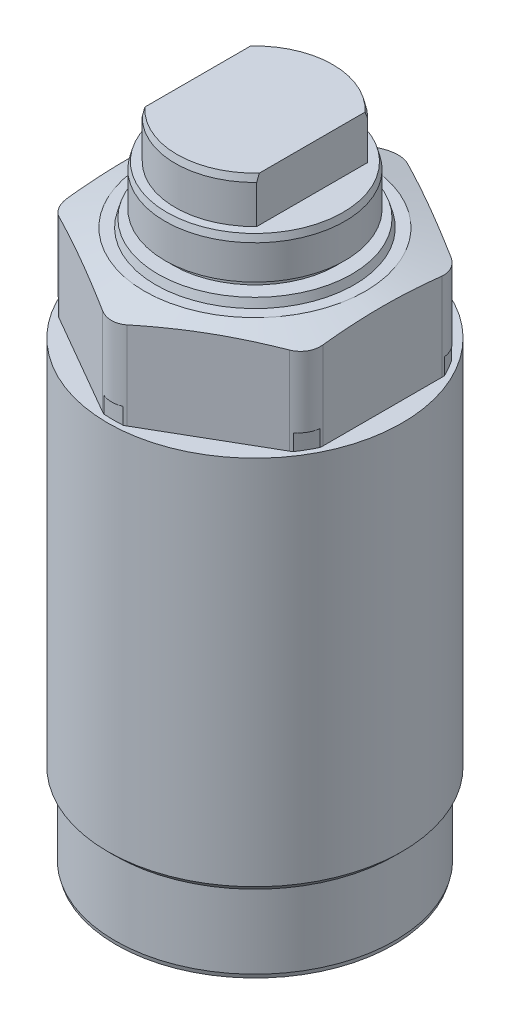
ISO-10303-21;
HEADER;
FILE_DESCRIPTION(('STEP AP214'),'2;1');
FILE_NAME('part.step','',(''),(''),'','','');
FILE_SCHEMA(('AUTOMOTIVE_DESIGN { 1 0 10303 214 1 1 1 1 }'));
ENDSEC;
DATA;
#1=APPLICATION_CONTEXT('core data for automotive mechanical design processes');
#2=APPLICATION_PROTOCOL_DEFINITION('international standard','automotive_design',2000,#1);
#3=PRODUCT_CONTEXT('',#1,'mechanical');
#4=PRODUCT('Part','Part','',(#3));
#5=PRODUCT_RELATED_PRODUCT_CATEGORY('part','',(#4));
#6=PRODUCT_DEFINITION_FORMATION('','',#4);
#7=PRODUCT_DEFINITION_CONTEXT('part definition',#1,'design');
#8=PRODUCT_DEFINITION('design','',#6,#7);
#9=PRODUCT_DEFINITION_SHAPE('','',#8);
#10=(LENGTH_UNIT() NAMED_UNIT(*) SI_UNIT(.MILLI.,.METRE.));
#11=(NAMED_UNIT(*) PLANE_ANGLE_UNIT() SI_UNIT($,.RADIAN.));
#12=(NAMED_UNIT(*) SI_UNIT($,.STERADIAN.) SOLID_ANGLE_UNIT());
#13=UNCERTAINTY_MEASURE_WITH_UNIT(LENGTH_MEASURE(1.E-05),#10,'distance_accuracy_value','');
#14=(GEOMETRIC_REPRESENTATION_CONTEXT(3) GLOBAL_UNCERTAINTY_ASSIGNED_CONTEXT((#13)) GLOBAL_UNIT_ASSIGNED_CONTEXT((#10,
#11,#12)) REPRESENTATION_CONTEXT('',''));
#15=CARTESIAN_POINT('',(0.,0.,0.));
#16=DIRECTION('',(0.,0.,1.));
#17=DIRECTION('',(1.,0.,0.));
#18=AXIS2_PLACEMENT_3D('',#15,#16,#17);
#19=CARTESIAN_POINT('',(0.,231.292322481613,0.));
#20=DIRECTION('',(0.,1.,0.));
#21=DIRECTION('',(0.,0.,1.));
#22=AXIS2_PLACEMENT_3D('',#19,#20,#21);
#23=CYLINDRICAL_SURFACE('',#22,9.75000035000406);
#24=DIRECTION('',(0.,1.,0.));
#25=VECTOR('',#24,1.);
#26=CARTESIAN_POINT('',(7.,231.292322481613,6.78693648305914));
#27=LINE('',#26,#25);
#28=CARTESIAN_POINT('',(7.,77.6700010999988,6.78693648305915));
#29=VERTEX_POINT('',#28);
#30=CARTESIAN_POINT('',(7.,72.9966678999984,6.78693648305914));
#31=VERTEX_POINT('',#30);
#32=EDGE_CURVE('E231',#29,#31,#27,.F.);
#33=ORIENTED_EDGE('',*,*,#32,.F.);
#34=CARTESIAN_POINT('',(0.,77.6700010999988,0.));
#35=DIRECTION('',(0.,1.,0.));
#36=DIRECTION('',(0.,0.,1.));
#37=AXIS2_PLACEMENT_3D('',#34,#35,#36);
#38=CIRCLE('',#37,9.75000035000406);
#39=CARTESIAN_POINT('',(-7.,77.6700010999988,6.78693648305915));
#40=VERTEX_POINT('',#39);
#41=EDGE_CURVE('E260',#40,#29,#38,.T.);
#42=ORIENTED_EDGE('',*,*,#41,.F.);
#43=DIRECTION('',(0.,1.,0.));
#44=VECTOR('',#43,1.);
#45=CARTESIAN_POINT('',(-7.,231.292322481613,6.78693648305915));
#46=LINE('',#45,#44);
#47=CARTESIAN_POINT('',(-7.,72.9966678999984,6.78693648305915));
#48=VERTEX_POINT('',#47);
#49=EDGE_CURVE('E254',#48,#40,#46,.T.);
#50=ORIENTED_EDGE('',*,*,#49,.F.);
#51=CARTESIAN_POINT('',(0.,72.9966678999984,0.));
#52=DIRECTION('',(0.,1.,0.));
#53=DIRECTION('',(0.,0.,1.));
#54=AXIS2_PLACEMENT_3D('',#51,#52,#53);
#55=CIRCLE('',#54,9.75000035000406);
#56=EDGE_CURVE('E250',#48,#31,#55,.T.);
#57=ORIENTED_EDGE('',*,*,#56,.T.);
#58=EDGE_LOOP('',(#33,#42,#50,#57));
#59=FACE_BOUND('',#58,.T.);
#60=ADVANCED_FACE('F34',(#59),#23,.T.);
#61=CARTESIAN_POINT('',(0.,78.5033344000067,0.));
#62=DIRECTION('',(0.,-1.,0.));
#63=DIRECTION('',(0.,0.,-1.));
#64=AXIS2_PLACEMENT_3D('',#61,#62,#63);
#65=CONICAL_SURFACE('',#64,9.52670936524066,0.261799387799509);
#66=CARTESIAN_POINT('',(7.,66.1675631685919,-10.75462703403));
#67=CARTESIAN_POINT('',(7.,66.8761499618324,-10.5280332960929));
#68=CARTESIAN_POINT('',(7.,67.5841551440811,-10.2995956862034));
#69=CARTESIAN_POINT('',(7.,68.9989229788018,-9.83792987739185));
#70=CARTESIAN_POINT('',(7.,69.7056850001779,-9.60469974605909));
#71=CARTESIAN_POINT('',(7.,71.1267031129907,-9.12938679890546));
#72=CARTESIAN_POINT('',(7.,71.8409336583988,-8.88722745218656));
#73=CARTESIAN_POINT('',(7.,73.2665975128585,-8.39562280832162));
#74=CARTESIAN_POINT('',(7.,73.9780317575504,-8.14618023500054));
#75=CARTESIAN_POINT('',(7.,75.1396941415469,-7.73010649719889));
#76=CARTESIAN_POINT('',(7.,75.5909357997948,-7.56630642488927));
#77=CARTESIAN_POINT('',(7.,76.4917089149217,-7.23407415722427));
#78=CARTESIAN_POINT('',(7.,76.9412403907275,-7.06564201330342));
#79=CARTESIAN_POINT('',(7.,77.8387498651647,-6.72292858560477));
#80=CARTESIAN_POINT('',(7.,78.2867250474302,-6.5486399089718));
#81=CARTESIAN_POINT('',(7.,79.1798702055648,-6.19309401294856));
#82=CARTESIAN_POINT('',(7.,79.6250404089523,-6.01183736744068));
#83=CARTESIAN_POINT('',(7.,80.5081838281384,-5.64193012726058));
#84=CARTESIAN_POINT('',(7.,80.9461861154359,-5.45334915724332));
#85=CARTESIAN_POINT('',(7.,81.8173310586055,-5.06476728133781));
#86=CARTESIAN_POINT('',(7.,82.250471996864,-4.86476248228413));
#87=CARTESIAN_POINT('',(7.,82.8941043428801,-4.55338499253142));
#88=CARTESIAN_POINT('',(7.,83.107404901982,-4.44781930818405));
#89=CARTESIAN_POINT('',(7.,83.5316619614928,-4.23208853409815));
#90=CARTESIAN_POINT('',(7.,83.7426185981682,-4.12192371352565));
#91=CARTESIAN_POINT('',(7.,84.1614244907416,-3.89612160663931));
#92=CARTESIAN_POINT('',(7.,84.3692755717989,-3.78048771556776));
#93=CARTESIAN_POINT('',(7.,84.781046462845,-3.54244601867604));
#94=CARTESIAN_POINT('',(7.,84.9849670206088,-3.42003951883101));
#95=CARTESIAN_POINT('',(7.,85.2776217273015,-3.23583258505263));
#96=CARTESIAN_POINT('',(7.,85.3684867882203,-3.17741142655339));
#97=CARTESIAN_POINT('',(7.,85.5489279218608,-3.05858678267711));
#98=CARTESIAN_POINT('',(7.,85.6385038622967,-2.99818309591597));
#99=CARTESIAN_POINT('',(7.,85.8162147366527,-2.87509666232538));
#100=CARTESIAN_POINT('',(7.,85.9043481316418,-2.81241168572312));
#101=CARTESIAN_POINT('',(7.,86.0787688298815,-2.68453162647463));
#102=CARTESIAN_POINT('',(7.,86.1650561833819,-2.61933661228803));
#103=CARTESIAN_POINT('',(7.,86.418018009,-2.42151906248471));
#104=CARTESIAN_POINT('',(7.,86.5815370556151,-2.28479524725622));
#105=CARTESIAN_POINT('',(7.,86.8954780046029,-1.99720619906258));
#106=CARTESIAN_POINT('',(7.,87.0459227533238,-1.84636663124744));
#107=CARTESIAN_POINT('',(7.,87.2797283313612,-1.57880862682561));
#108=CARTESIAN_POINT('',(7.,87.3688696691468,-1.46720321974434));
#109=CARTESIAN_POINT('',(7.,87.5337255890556,-1.23406106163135));
#110=CARTESIAN_POINT('',(7.,87.6094239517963,-1.11251256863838));
#111=CARTESIAN_POINT('',(7.,87.7424147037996,-0.856921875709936));
#112=CARTESIAN_POINT('',(7.,87.7993956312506,-0.722711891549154));
#113=CARTESIAN_POINT('',(7.,87.8852548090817,-0.445659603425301));
#114=CARTESIAN_POINT('',(7.,87.9142333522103,-0.302850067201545));
#115=CARTESIAN_POINT('',(7.,87.9369531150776,-0.0343095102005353));
#116=CARTESIAN_POINT('',(7.,87.9350124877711,0.0910527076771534));
#117=CARTESIAN_POINT('',(7.,87.9066233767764,0.339028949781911));
#118=CARTESIAN_POINT('',(7.,87.8801409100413,0.461638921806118));
#119=CARTESIAN_POINT('',(7.,87.8005822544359,0.719480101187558));
#120=CARTESIAN_POINT('',(7.,87.7439132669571,0.853568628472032));
#121=CARTESIAN_POINT('',(7.,87.6103679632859,1.11116137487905));
#122=CARTESIAN_POINT('',(7.,87.5334540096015,1.23464530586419));
#123=CARTESIAN_POINT('',(7.,87.3720318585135,1.46254243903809));
#124=CARTESIAN_POINT('',(7.,87.288538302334,1.56769165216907));
#125=CARTESIAN_POINT('',(7.,87.1129125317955,1.77058381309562));
#126=CARTESIAN_POINT('',(7.,87.0207721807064,1.86831962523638));
#127=CARTESIAN_POINT('',(7.,86.8299146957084,2.05772918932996));
#128=CARTESIAN_POINT('',(7.,86.7311767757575,2.14938177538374));
#129=CARTESIAN_POINT('',(7.,86.5290198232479,2.32722362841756));
#130=CARTESIAN_POINT('',(7.,86.4256030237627,2.41341545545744));
#131=CARTESIAN_POINT('',(7.,86.1238725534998,2.65405620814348));
#132=CARTESIAN_POINT('',(7.,85.9210617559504,2.80285497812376));
#133=CARTESIAN_POINT('',(7.,85.5072554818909,3.08868707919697));
#134=CARTESIAN_POINT('',(7.,85.296254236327,3.22571189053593));
#135=CARTESIAN_POINT('',(7.,84.8681506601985,3.49090978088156));
#136=CARTESIAN_POINT('',(7.,84.6510359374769,3.61906273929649));
#137=CARTESIAN_POINT('',(7.,84.2126820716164,3.86812076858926));
#138=CARTESIAN_POINT('',(7.,83.991442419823,3.98902493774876));
#139=CARTESIAN_POINT('',(7.,83.5439540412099,4.22596695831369));
#140=CARTESIAN_POINT('',(7.,83.3176786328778,4.34195421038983));
#141=CARTESIAN_POINT('',(7.,82.8626653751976,4.56901124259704));
#142=CARTESIAN_POINT('',(7.,82.6339273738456,4.68008071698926));
#143=CARTESIAN_POINT('',(7.,82.1748435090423,4.89793267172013));
#144=CARTESIAN_POINT('',(7.,81.9445005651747,5.00472132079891));
#145=CARTESIAN_POINT('',(7.,81.48223609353,5.2148025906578));
#146=CARTESIAN_POINT('',(7.,81.2503146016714,5.31809529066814));
#147=CARTESIAN_POINT('',(7.,80.7089706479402,5.55503062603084));
#148=CARTESIAN_POINT('',(7.,80.3990484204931,5.6875306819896));
#149=CARTESIAN_POINT('',(7.,79.7773611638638,5.9481414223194));
#150=CARTESIAN_POINT('',(7.,79.4655960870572,6.07625199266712));
#151=CARTESIAN_POINT('',(7.,78.5280154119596,6.45508600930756));
#152=CARTESIAN_POINT('',(7.,77.8999685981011,6.70028834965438));
#153=CARTESIAN_POINT('',(7.,76.6390605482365,7.18013932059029));
#154=CARTESIAN_POINT('',(7.,76.006194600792,7.4147754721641));
#155=CARTESIAN_POINT('',(7.,74.7374743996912,7.87569850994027));
#156=CARTESIAN_POINT('',(7.,74.1016203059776,8.10198583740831));
#157=CARTESIAN_POINT('',(7.,72.8590918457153,8.53696999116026));
#158=CARTESIAN_POINT('',(7.,72.2525280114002,8.74598352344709));
#159=CARTESIAN_POINT('',(7.,71.0377438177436,9.15917051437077));
#160=CARTESIAN_POINT('',(7.,70.4295234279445,9.36334388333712));
#161=CARTESIAN_POINT('',(7.,69.2129559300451,9.76728702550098));
#162=CARTESIAN_POINT('',(7.,68.6046114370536,9.96706468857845));
#163=CARTESIAN_POINT('',(7.,67.3868453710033,10.3632323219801));
#164=CARTESIAN_POINT('',(7.,66.7774238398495,10.5596224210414));
#165=CARTESIAN_POINT('',(7.,66.1675631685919,10.75462703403));
#166=B_SPLINE_CURVE_WITH_KNOTS('',3,(#66,#67,#68,#69,#70,#71,#72,#73,#74,#75,#76,#77,#78,#79,
#80,#81,#82,#83,#84,#85,#86,#87,#88,#89,#90,#91,#92,#93,#94,#95,#96,#97,#98,#99,#100,#101,#102,
#103,#104,#105,#106,#107,#108,#109,#110,#111,#112,#113,#114,#115,#116,#117,#118,#119,#120,#121,
#122,#123,#124,#125,#126,#127,#128,#129,#130,#131,#132,#133,#134,#135,#136,#137,#138,#139,#140,
#141,#142,#143,#144,#145,#146,#147,#148,#149,#150,#151,#152,#153,#154,#155,#156,#157,#158,#159,
#160,#161,#162,#163,#164,#165),.UNSPECIFIED.,.F.,.F.,(4,2,2,2,2,2,2,2,2,2,2,2,2,2,2,2,2,2,2,2,2,
2,2,2,2,2,2,2,2,2,2,2,2,2,2,2,2,2,2,2,2,2,2,2,2,2,2,2,2,4),(0.,2.23181544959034,4.4645491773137,
6.72701732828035,8.9886499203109,10.4287847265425,11.8689035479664,13.3109141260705,
14.7528061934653,16.1833213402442,17.6143269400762,18.3282670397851,19.0421654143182,
19.7556262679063,20.4689500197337,20.7930055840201,21.1170941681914,21.4415085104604,
21.7659140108,22.4047807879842,23.0425077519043,23.4703065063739,23.898617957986,
24.3337327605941,24.7672833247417,25.1408881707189,25.5150111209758,25.9493194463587,
26.3844409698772,26.7866463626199,27.1892341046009,27.593156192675,27.9968874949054,
28.7508506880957,29.5053549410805,30.2615177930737,31.0177745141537,31.7805140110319,
32.5433008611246,33.3049458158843,34.0665734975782,35.0777035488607,36.0888598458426,
38.1113495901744,40.1361684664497,42.1608801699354,44.0855531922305,46.0102618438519,
47.9311749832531,49.8520149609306),.UNSPECIFIED.);
#167=CARTESIAN_POINT('',(7.,77.6700010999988,-6.78693648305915));
#168=VERTEX_POINT('',#167);
#169=CARTESIAN_POINT('',(7.,78.5033344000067,-6.46205782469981));
#170=VERTEX_POINT('',#169);
#171=EDGE_CURVE('E242',#168,#170,#166,.T.);
#172=ORIENTED_EDGE('',*,*,#171,.F.);
#173=CARTESIAN_POINT('',(-7.,77.6700010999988,-6.78693648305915));
#174=VERTEX_POINT('',#173);
#175=EDGE_CURVE('E466',#168,#174,#38,.T.);
#176=ORIENTED_EDGE('',*,*,#175,.T.);
#177=CARTESIAN_POINT('',(-7.,66.1675631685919,10.75462703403));
#178=CARTESIAN_POINT('',(-7.,66.8761499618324,10.5280332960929));
#179=CARTESIAN_POINT('',(-7.,67.5841551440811,10.2995956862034));
#180=CARTESIAN_POINT('',(-7.,68.9989229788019,9.83792987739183));
#181=CARTESIAN_POINT('',(-7.,69.7056850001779,9.60469974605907));
#182=CARTESIAN_POINT('',(-7.,71.1267031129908,9.12938679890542));
#183=CARTESIAN_POINT('',(-7.,71.8409336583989,8.88722745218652));
#184=CARTESIAN_POINT('',(-7.,73.2665975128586,8.39562280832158));
#185=CARTESIAN_POINT('',(-7.,73.9780317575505,8.14618023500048));
#186=CARTESIAN_POINT('',(-7.,75.1396941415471,7.73010649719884));
#187=CARTESIAN_POINT('',(-7.,75.5909357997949,7.56630642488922));
#188=CARTESIAN_POINT('',(-7.,76.4917089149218,7.23407415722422));
#189=CARTESIAN_POINT('',(-7.,76.9412403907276,7.06564201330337));
#190=CARTESIAN_POINT('',(-7.,77.8387498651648,6.72292858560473));
#191=CARTESIAN_POINT('',(-7.,78.2867250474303,6.54863990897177));
#192=CARTESIAN_POINT('',(-7.,79.1798702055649,6.19309401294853));
#193=CARTESIAN_POINT('',(-7.,79.6250404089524,6.01183736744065));
#194=CARTESIAN_POINT('',(-7.,80.5081838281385,5.64193012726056));
#195=CARTESIAN_POINT('',(-7.,80.946186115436,5.4533491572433));
#196=CARTESIAN_POINT('',(-7.,81.8173310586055,5.06476728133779));
#197=CARTESIAN_POINT('',(-7.,82.2504719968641,4.86476248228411));
#198=CARTESIAN_POINT('',(-7.,82.8941043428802,4.55338499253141));
#199=CARTESIAN_POINT('',(-7.,83.107404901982,4.44781930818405));
#200=CARTESIAN_POINT('',(-7.,83.5316619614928,4.23208853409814));
#201=CARTESIAN_POINT('',(-7.,83.7426185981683,4.12192371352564));
#202=CARTESIAN_POINT('',(-7.,84.1614244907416,3.8961216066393));
#203=CARTESIAN_POINT('',(-7.,84.3692755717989,3.78048771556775));
#204=CARTESIAN_POINT('',(-7.,84.781046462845,3.54244601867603));
#205=CARTESIAN_POINT('',(-7.,84.9849670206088,3.420039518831));
#206=CARTESIAN_POINT('',(-7.,85.2776217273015,3.23583258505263));
#207=CARTESIAN_POINT('',(-7.,85.3684867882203,3.17741142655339));
#208=CARTESIAN_POINT('',(-7.,85.5489279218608,3.05858678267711));
#209=CARTESIAN_POINT('',(-7.,85.6385038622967,2.99818309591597));
#210=CARTESIAN_POINT('',(-7.,85.8162147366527,2.87509666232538));
#211=CARTESIAN_POINT('',(-7.,85.9043481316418,2.81241168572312));
#212=CARTESIAN_POINT('',(-7.,86.0787688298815,2.68453162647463));
#213=CARTESIAN_POINT('',(-7.,86.1650561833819,2.61933661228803));
#214=CARTESIAN_POINT('',(-7.,86.418018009,2.42151906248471));
#215=CARTESIAN_POINT('',(-7.,86.5815370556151,2.28479524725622));
#216=CARTESIAN_POINT('',(-7.,86.8954780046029,1.99720619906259));
#217=CARTESIAN_POINT('',(-7.,87.0459227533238,1.84636663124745));
#218=CARTESIAN_POINT('',(-7.,87.2797283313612,1.57880862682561));
#219=CARTESIAN_POINT('',(-7.,87.3688696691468,1.46720321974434));
#220=CARTESIAN_POINT('',(-7.,87.5337255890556,1.23406106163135));
#221=CARTESIAN_POINT('',(-7.,87.6094239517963,1.11251256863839));
#222=CARTESIAN_POINT('',(-7.,87.7424147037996,0.856921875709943));
#223=CARTESIAN_POINT('',(-7.,87.7993956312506,0.722711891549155));
#224=CARTESIAN_POINT('',(-7.,87.8852548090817,0.4456596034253));
#225=CARTESIAN_POINT('',(-7.,87.9142333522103,0.302850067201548));
#226=CARTESIAN_POINT('',(-7.,87.9369531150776,0.0343095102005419));
#227=CARTESIAN_POINT('',(-7.,87.9350124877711,-0.0910527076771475));
#228=CARTESIAN_POINT('',(-7.,87.9066233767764,-0.339028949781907));
#229=CARTESIAN_POINT('',(-7.,87.8801409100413,-0.461638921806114));
#230=CARTESIAN_POINT('',(-7.,87.800582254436,-0.719480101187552));
#231=CARTESIAN_POINT('',(-7.,87.7439132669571,-0.853568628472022));
#232=CARTESIAN_POINT('',(-7.,87.6103679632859,-1.11116137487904));
#233=CARTESIAN_POINT('',(-7.,87.5334540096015,-1.23464530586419));
#234=CARTESIAN_POINT('',(-7.,87.3720318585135,-1.46254243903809));
#235=CARTESIAN_POINT('',(-7.,87.288538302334,-1.56769165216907));
#236=CARTESIAN_POINT('',(-7.,87.1129125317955,-1.77058381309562));
#237=CARTESIAN_POINT('',(-7.,87.0207721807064,-1.86831962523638));
#238=CARTESIAN_POINT('',(-7.,86.8299146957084,-2.05772918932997));
#239=CARTESIAN_POINT('',(-7.,86.7311767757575,-2.14938177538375));
#240=CARTESIAN_POINT('',(-7.,86.5290198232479,-2.32722362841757));
#241=CARTESIAN_POINT('',(-7.,86.4256030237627,-2.41341545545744));
#242=CARTESIAN_POINT('',(-7.,86.1238725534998,-2.65405620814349));
#243=CARTESIAN_POINT('',(-7.,85.9210617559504,-2.80285497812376));
#244=CARTESIAN_POINT('',(-7.,85.5072554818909,-3.08868707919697));
#245=CARTESIAN_POINT('',(-7.,85.296254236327,-3.22571189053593));
#246=CARTESIAN_POINT('',(-7.,84.8681506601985,-3.49090978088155));
#247=CARTESIAN_POINT('',(-7.,84.6510359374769,-3.61906273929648));
#248=CARTESIAN_POINT('',(-7.,84.2126820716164,-3.86812076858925));
#249=CARTESIAN_POINT('',(-7.,83.991442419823,-3.98902493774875));
#250=CARTESIAN_POINT('',(-7.,83.5439540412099,-4.22596695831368));
#251=CARTESIAN_POINT('',(-7.,83.3176786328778,-4.34195421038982));
#252=CARTESIAN_POINT('',(-7.,82.8626653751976,-4.56901124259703));
#253=CARTESIAN_POINT('',(-7.,82.6339273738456,-4.68008071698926));
#254=CARTESIAN_POINT('',(-7.,82.1748435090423,-4.89793267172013));
#255=CARTESIAN_POINT('',(-7.,81.9445005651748,-5.0047213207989));
#256=CARTESIAN_POINT('',(-7.,81.48223609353,-5.2148025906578));
#257=CARTESIAN_POINT('',(-7.,81.2503146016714,-5.31809529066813));
#258=CARTESIAN_POINT('',(-7.,80.7089706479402,-5.55503062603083));
#259=CARTESIAN_POINT('',(-7.,80.3990484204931,-5.6875306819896));
#260=CARTESIAN_POINT('',(-7.,79.7773611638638,-5.94814142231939));
#261=CARTESIAN_POINT('',(-7.,79.4655960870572,-6.07625199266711));
#262=CARTESIAN_POINT('',(-7.,78.5280154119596,-6.45508600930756));
#263=CARTESIAN_POINT('',(-7.,77.8999685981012,-6.70028834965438));
#264=CARTESIAN_POINT('',(-7.,76.6390605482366,-7.18013932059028));
#265=CARTESIAN_POINT('',(-7.,76.0061946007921,-7.41477547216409));
#266=CARTESIAN_POINT('',(-7.,74.7374743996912,-7.87569850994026));
#267=CARTESIAN_POINT('',(-7.,74.1016203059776,-8.1019858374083));
#268=CARTESIAN_POINT('',(-7.,72.8590918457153,-8.53696999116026));
#269=CARTESIAN_POINT('',(-7.,72.2525280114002,-8.74598352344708));
#270=CARTESIAN_POINT('',(-7.,71.0377438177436,-9.15917051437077));
#271=CARTESIAN_POINT('',(-7.,70.4295234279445,-9.36334388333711));
#272=CARTESIAN_POINT('',(-7.,69.2129559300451,-9.76728702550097));
#273=CARTESIAN_POINT('',(-7.,68.6046114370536,-9.96706468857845));
#274=CARTESIAN_POINT('',(-7.,67.3868453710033,-10.3632323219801));
#275=CARTESIAN_POINT('',(-7.,66.7774238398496,-10.5596224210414));
#276=CARTESIAN_POINT('',(-7.,66.1675631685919,-10.75462703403));
#277=B_SPLINE_CURVE_WITH_KNOTS('',3,(#177,#178,#179,#180,#181,#182,#183,#184,#185,#186,#187,
#188,#189,#190,#191,#192,#193,#194,#195,#196,#197,#198,#199,#200,#201,#202,#203,#204,#205,#206,
#207,#208,#209,#210,#211,#212,#213,#214,#215,#216,#217,#218,#219,#220,#221,#222,#223,#224,#225,
#226,#227,#228,#229,#230,#231,#232,#233,#234,#235,#236,#237,#238,#239,#240,#241,#242,#243,#244,
#245,#246,#247,#248,#249,#250,#251,#252,#253,#254,#255,#256,#257,#258,#259,#260,#261,#262,#263,
#264,#265,#266,#267,#268,#269,#270,#271,#272,#273,#274,#275,#276),.UNSPECIFIED.,.F.,.F.,(4,2,2,
2,2,2,2,2,2,2,2,2,2,2,2,2,2,2,2,2,2,2,2,2,2,2,2,2,2,2,2,2,2,2,2,2,2,2,2,2,2,2,2,2,2,2,2,2,2,4),
(0.,2.2318154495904,4.4645491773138,6.72701732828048,8.98864992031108,10.4287847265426,
11.8689035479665,13.3109141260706,14.7528061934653,16.1833213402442,17.6143269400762,
18.3282670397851,19.0421654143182,19.7556262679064,20.4689500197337,20.7930055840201,
21.1170941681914,21.4415085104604,21.7659140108,22.4047807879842,23.0425077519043,
23.4703065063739,23.898617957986,24.3337327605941,24.7672833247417,25.1408881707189,
25.5150111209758,25.9493194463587,26.3844409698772,26.7866463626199,27.1892341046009,
27.5931561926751,27.9968874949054,28.7508506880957,29.5053549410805,30.2615177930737,
31.0177745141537,31.7805140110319,32.5433008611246,33.3049458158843,34.0665734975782,
35.0777035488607,36.0888598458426,38.1113495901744,40.1361684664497,42.1608801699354,
44.0855531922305,46.0102618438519,47.9311749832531,49.8520149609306),.UNSPECIFIED.);
#278=CARTESIAN_POINT('',(-7.,78.5033344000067,-6.46205782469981));
#279=VERTEX_POINT('',#278);
#280=EDGE_CURVE('E470',#279,#174,#277,.T.);
#281=ORIENTED_EDGE('',*,*,#280,.F.);
#282=CARTESIAN_POINT('',(0.,78.5033344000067,0.));
#283=DIRECTION('',(0.,1.,0.));
#284=DIRECTION('',(0.,0.,1.));
#285=AXIS2_PLACEMENT_3D('',#282,#283,#284);
#286=CIRCLE('',#285,9.52670936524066);
#287=EDGE_CURVE('E643',#170,#279,#286,.T.);
#288=ORIENTED_EDGE('',*,*,#287,.F.);
#289=EDGE_LOOP('',(#172,#176,#281,#288));
#290=FACE_BOUND('',#289,.T.);
#291=ADVANCED_FACE('F344',(#290),#65,.T.);
#292=CARTESIAN_POINT('',(0.,66.0033344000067,0.));
#293=DIRECTION('',(0.,-1.,0.));
#294=DIRECTION('',(0.,0.,-1.));
#295=AXIS2_PLACEMENT_3D('',#292,#293,#294);
#296=CONICAL_SURFACE('',#295,13.5000005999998,1.30899693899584);
#297=CARTESIAN_POINT('',(0.,66.0033344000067,0.));
#298=DIRECTION('',(0.,1.,0.));
#299=DIRECTION('',(0.,0.,1.));
#300=AXIS2_PLACEMENT_3D('',#297,#298,#299);
#301=CIRCLE('',#300,13.5000005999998);
#302=CARTESIAN_POINT('',(0.,66.0033344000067,13.5000005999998));
#303=VERTEX_POINT('',#302);
#304=EDGE_CURVE('E281',#303,#303,#301,.T.);
#305=ORIENTED_EDGE('',*,*,#304,.F.);
#306=EDGE_LOOP('',(#305));
#307=FACE_BOUND('',#306,.T.);
#308=CARTESIAN_POINT('',(15.5884572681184,62.0075354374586,-23.7544016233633));
#309=CARTESIAN_POINT('',(15.5884572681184,62.1657869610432,-23.0477939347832));
#310=CARTESIAN_POINT('',(15.5884572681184,62.3220939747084,-22.3407427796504));
#311=CARTESIAN_POINT('',(15.5884572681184,62.6297694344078,-20.9255358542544));
#312=CARTESIAN_POINT('',(15.5884572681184,62.7811376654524,-20.2173800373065));
#313=CARTESIAN_POINT('',(15.5884572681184,63.0780191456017,-18.799104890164));
#314=CARTESIAN_POINT('',(15.5884572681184,63.2235264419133,-18.0889843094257));
#315=CARTESIAN_POINT('',(15.5884572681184,63.5071068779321,-16.6672611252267));
#316=CARTESIAN_POINT('',(15.5884572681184,63.6451800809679,-15.9556585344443));
#317=CARTESIAN_POINT('',(15.5884572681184,63.9110488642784,-14.5364444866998));
#318=CARTESIAN_POINT('',(15.5884572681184,64.0389181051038,-13.8288468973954));
#319=CARTESIAN_POINT('',(15.5884572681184,64.2834370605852,-12.4117003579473));
#320=CARTESIAN_POINT('',(15.5884572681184,64.4000867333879,-11.7021514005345));
#321=CARTESIAN_POINT('',(15.5884572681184,64.6195236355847,-10.2809976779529));
#322=CARTESIAN_POINT('',(15.5884572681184,64.7223128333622,-9.56939321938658));
#323=CARTESIAN_POINT('',(15.5884572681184,64.9109917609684,-8.14392170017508));
#324=CARTESIAN_POINT('',(15.5884572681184,64.9968814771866,-7.43005463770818));
#325=CARTESIAN_POINT('',(15.5884572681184,65.149318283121,-5.99202249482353));
#326=CARTESIAN_POINT('',(15.5884572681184,65.2156344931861,-5.26783257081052));
#327=CARTESIAN_POINT('',(15.5884572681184,65.3243417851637,-3.81764383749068));
#328=CARTESIAN_POINT('',(15.5884572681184,65.3667334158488,-3.0916450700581));
#329=CARTESIAN_POINT('',(15.5884572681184,65.425118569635,-1.63889132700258));
#330=CARTESIAN_POINT('',(15.5884572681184,65.4411239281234,-0.912136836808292));
#331=CARTESIAN_POINT('',(15.5884572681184,65.445753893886,0.541460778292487));
#332=CARTESIAN_POINT('',(15.5884572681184,65.4343785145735,1.26830390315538));
#333=CARTESIAN_POINT('',(15.5884572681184,65.3848860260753,2.72372866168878));
#334=CARTESIAN_POINT('',(15.5884572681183,65.3466710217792,3.45230689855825));
#335=CARTESIAN_POINT('',(15.5884572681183,65.2456744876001,4.90774282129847));
#336=CARTESIAN_POINT('',(15.5884572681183,65.1828924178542,5.63460046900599));
#337=CARTESIAN_POINT('',(15.5884572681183,65.0359196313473,7.08659182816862));
#338=CARTESIAN_POINT('',(15.5884572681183,64.9517150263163,7.81172411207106));
#339=CARTESIAN_POINT('',(15.5884572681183,64.765384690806,9.25965689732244));
#340=CARTESIAN_POINT('',(15.5884572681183,64.6632589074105,9.98245739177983));
#341=CARTESIAN_POINT('',(15.5884572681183,64.4511549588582,11.3808546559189));
#342=CARTESIAN_POINT('',(15.5884572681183,64.342062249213,12.0565870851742));
#343=CARTESIAN_POINT('',(15.5884572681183,64.1132998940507,13.4062679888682));
#344=CARTESIAN_POINT('',(15.5884572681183,63.9936299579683,14.0802164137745));
#345=CARTESIAN_POINT('',(15.5884572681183,63.7456496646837,15.4265844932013));
#346=CARTESIAN_POINT('',(15.5884572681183,63.617338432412,16.0990039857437));
#347=CARTESIAN_POINT('',(15.5884572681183,63.35367303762,17.4424493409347));
#348=CARTESIAN_POINT('',(15.5884572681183,63.2183189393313,18.1134752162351));
#349=CARTESIAN_POINT('',(15.5884572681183,62.9418084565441,19.4544957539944));
#350=CARTESIAN_POINT('',(15.5884572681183,62.8006506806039,20.1244901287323));
#351=CARTESIAN_POINT('',(15.5884572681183,62.5135829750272,21.4634589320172));
#352=CARTESIAN_POINT('',(15.5884572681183,62.3676730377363,22.1324333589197));
#353=CARTESIAN_POINT('',(15.5884572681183,62.0719271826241,23.4694673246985));
#354=CARTESIAN_POINT('',(15.5884572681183,61.9220915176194,24.1375269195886));
#355=CARTESIAN_POINT('',(15.5884572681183,61.6191332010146,25.4729010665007));
#356=CARTESIAN_POINT('',(15.5884572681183,61.4660105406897,26.1402156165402));
#357=CARTESIAN_POINT('',(15.5884572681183,61.0056113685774,28.1278890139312));
#358=CARTESIAN_POINT('',(15.5884572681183,60.6943281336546,29.4473197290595));
#359=CARTESIAN_POINT('',(15.5884572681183,60.0640170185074,32.0843478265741));
#360=CARTESIAN_POINT('',(15.5884572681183,59.7449889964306,33.4019451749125));
#361=CARTESIAN_POINT('',(15.5884572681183,59.1015807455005,36.0341065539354));
#362=CARTESIAN_POINT('',(15.5884572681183,58.7772076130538,37.3486723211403));
#363=CARTESIAN_POINT('',(15.5884572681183,58.2873867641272,39.3196862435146));
#364=CARTESIAN_POINT('',(15.5884572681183,58.1235722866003,39.9765411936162));
#365=CARTESIAN_POINT('',(15.5884572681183,57.7949799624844,41.2900093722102));
#366=CARTESIAN_POINT('',(15.5884572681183,57.6302021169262,41.9466226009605));
#367=CARTESIAN_POINT('',(15.5884572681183,57.4650050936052,42.603130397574));
#368=B_SPLINE_CURVE_WITH_KNOTS('',3,(#308,#309,#310,#311,#312,#313,#314,#315,#316,#317,#318,
#319,#320,#321,#322,#323,#324,#325,#326,#327,#328,#329,#330,#331,#332,#333,#334,#335,#336,#337,
#338,#339,#340,#341,#342,#343,#344,#345,#346,#347,#348,#349,#350,#351,#352,#353,#354,#355,#356,
#357,#358,#359,#360,#361,#362,#363,#364,#365,#366,#367),.UNSPECIFIED.,.F.,.F.,(4,2,2,2,2,2,2,2,
2,2,2,2,2,2,2,2,2,2,2,2,2,2,2,2,2,2,2,2,2,4),(0.,2.17234445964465,4.34478335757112,
6.51937579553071,8.69394970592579,10.8510525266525,13.0081633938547,15.1649675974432,
17.3217735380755,19.5030872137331,21.6843508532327,23.8646358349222,26.0449197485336,
28.2331976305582,30.4215236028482,32.6112719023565,34.8010266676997,36.8543732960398,
38.90777634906,40.9613876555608,43.0149802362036,45.0690680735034,47.1231592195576,
49.177118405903,51.2310830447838,55.2980040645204,59.3649996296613,63.4269725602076,
65.4578936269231,67.4888125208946),.UNSPECIFIED.);
#369=CARTESIAN_POINT('',(15.5884572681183,65.0120543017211,7.26794919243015));
#370=VERTEX_POINT('',#369);
#371=CARTESIAN_POINT('',(15.5884572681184,65.0120543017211,-7.26794919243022));
#372=VERTEX_POINT('',#371);
#373=EDGE_CURVE('E320',#370,#372,#368,.F.);
#374=ORIENTED_EDGE('',*,*,#373,.T.);
#375=CARTESIAN_POINT('',(15.5884572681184,65.0120543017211,-7.26794919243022));
#376=CARTESIAN_POINT('',(15.5884658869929,65.0027328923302,-7.35026427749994));
#377=CARTESIAN_POINT('',(15.5850693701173,64.9940978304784,-7.43265602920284));
#378=CARTESIAN_POINT('',(15.5714928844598,64.9782391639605,-7.59701676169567));
#379=CARTESIAN_POINT('',(15.5613127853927,64.9710155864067,-7.67898573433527));
#380=CARTESIAN_POINT('',(15.534207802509,64.9580246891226,-7.84185042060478));
#381=CARTESIAN_POINT('',(15.5172888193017,64.9522561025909,-7.92274700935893));
#382=CARTESIAN_POINT('',(15.4768196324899,64.9421970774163,-8.08293195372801));
#383=CARTESIAN_POINT('',(15.4532696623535,64.9379065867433,-8.16222036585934));
#384=CARTESIAN_POINT('',(15.3728230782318,64.9272859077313,-8.39693390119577));
#385=CARTESIAN_POINT('',(15.3061247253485,64.9232041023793,-8.54923769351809));
#386=CARTESIAN_POINT('',(15.1484991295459,64.9211508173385,-8.84074274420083));
#387=CARTESIAN_POINT('',(15.0575661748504,64.9231807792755,-8.97994090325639));
#388=CARTESIAN_POINT('',(14.8546249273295,64.9332746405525,-9.2406767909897));
#389=CARTESIAN_POINT('',(14.7427186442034,64.9413098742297,-9.36229515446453));
#390=CARTESIAN_POINT('',(14.5009064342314,64.9632140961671,-9.58516368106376));
#391=CARTESIAN_POINT('',(14.3710339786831,64.9770723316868,-9.686450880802));
#392=CARTESIAN_POINT('',(14.2103527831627,64.9965680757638,-9.79189020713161));
#393=CARTESIAN_POINT('',(14.186243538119,64.9995512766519,-9.80722035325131));
#394=CARTESIAN_POINT('',(14.1376420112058,65.0056803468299,-9.83715857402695));
#395=CARTESIAN_POINT('',(14.1131502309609,65.0088260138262,-9.8517675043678));
#396=CARTESIAN_POINT('',(14.0884572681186,65.012054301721,-9.86602540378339));
#397=B_SPLINE_CURVE_WITH_KNOTS('',3,(#375,#376,#377,#378,#379,#380,#381,#382,#383,#384,#385,
#386,#387,#388,#389,#390,#391,#392,#393,#394,#395,#396),.UNSPECIFIED.,.F.,.F.,(4,2,2,2,2,2,2,2,
2,2,4),(0.,0.248448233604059,0.496901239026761,0.745137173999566,0.99336437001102,
1.48972728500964,1.98620728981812,2.48033240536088,2.97354905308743,3.05972238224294,
3.14579088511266),.UNSPECIFIED.);
#398=CARTESIAN_POINT('',(14.0884572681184,65.0120543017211,-9.86602540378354));
#399=VERTEX_POINT('',#398);
#400=EDGE_CURVE('E413',#372,#399,#397,.T.);
#401=ORIENTED_EDGE('',*,*,#400,.T.);
#402=CARTESIAN_POINT('',(15.5886572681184,64.7975322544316,-8.99988452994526));
#403=CARTESIAN_POINT('',(14.9412911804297,64.8977199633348,-9.37364151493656));
#404=CARTESIAN_POINT('',(14.2927513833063,64.9886737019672,-9.74807614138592));
#405=CARTESIAN_POINT('',(12.9933815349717,65.1484706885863,-10.4982676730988));
#406=CARTESIAN_POINT('',(12.3425506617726,65.2173049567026,-10.8740250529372));
#407=CARTESIAN_POINT('',(11.0425444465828,65.3288446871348,-11.6245839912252));
#408=CARTESIAN_POINT('',(10.3933778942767,65.3716831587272,-11.9993804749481));
#409=CARTESIAN_POINT('',(9.0942169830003,65.4291251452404,-12.7494513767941));
#410=CARTESIAN_POINT('',(8.44422280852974,65.4437341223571,-13.1247256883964));
#411=CARTESIAN_POINT('',(7.14423445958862,65.4437341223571,-13.8752743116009));
#412=CARTESIAN_POINT('',(6.49424028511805,65.4291251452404,-14.2505486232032));
#413=CARTESIAN_POINT('',(5.1950793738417,65.3716831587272,-15.0006195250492));
#414=CARTESIAN_POINT('',(4.5459128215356,65.3288446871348,-15.3754160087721));
#415=CARTESIAN_POINT('',(3.24590660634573,65.2173049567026,-16.1259749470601));
#416=CARTESIAN_POINT('',(2.5950757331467,65.1484706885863,-16.5017323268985));
#417=CARTESIAN_POINT('',(1.29570588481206,64.9886737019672,-17.2519238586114));
#418=CARTESIAN_POINT('',(0.647166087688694,64.8977199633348,-17.6263584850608));
#419=CARTESIAN_POINT('',(-0.000199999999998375,64.7975322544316,-18.0001154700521));
#420=B_SPLINE_CURVE_WITH_KNOTS('',3,(#402,#403,#404,#405,#406,#407,#408,#409,#410,#411,#412,
#413,#414,#415,#416,#417,#418,#419),.UNSPECIFIED.,.F.,.F.,(4,2,2,2,2,2,2,2,4),(0.,
2.26271271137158,4.52634286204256,6.77829113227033,9.02980362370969,11.281316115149,
13.5332643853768,15.7968945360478,18.0596072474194),.UNSPECIFIED.);
#421=CARTESIAN_POINT('',(1.5,65.0120543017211,-17.1339745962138));
#422=VERTEX_POINT('',#421);
#423=EDGE_CURVE('E376',#399,#422,#420,.T.);
#424=ORIENTED_EDGE('',*,*,#423,.T.);
#425=CARTESIAN_POINT('',(1.5,65.0120543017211,-17.1339745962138));
#426=CARTESIAN_POINT('',(1.4287173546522,65.0027328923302,-17.1751396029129));
#427=CARTESIAN_POINT('',(1.35566574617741,64.9940978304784,-17.2133940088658));
#428=CARTESIAN_POINT('',(1.20653693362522,64.9782391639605,-17.2838167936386));
#429=CARTESIAN_POINT('',(1.13045967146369,64.9710155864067,-17.3159850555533));
#430=CARTESIAN_POINT('',(0.975862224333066,64.9580246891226,-17.3739437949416));
#431=CARTESIAN_POINT('',(0.897344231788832,64.9522561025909,-17.399739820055));
#432=CARTESIAN_POINT('',(0.738385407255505,64.9421970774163,-17.44478494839));
#433=CARTESIAN_POINT('',(0.657944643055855,64.9379065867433,-17.4640342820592));
#434=CARTESIAN_POINT('',(0.414453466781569,64.9272859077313,-17.5117222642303));
#435=CARTESIAN_POINT('',(0.249205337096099,64.9232041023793,-17.530111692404));
#436=CARTESIAN_POINT('',(-0.0820582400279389,64.9211508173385,-17.5393564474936));
#437=CARTESIAN_POINT('',(-0.248073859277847,64.9231807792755,-17.5302052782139));
#438=CARTESIAN_POINT('',(-0.575348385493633,64.9332746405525,-17.4848209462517));
#439=CARTESIAN_POINT('',(-0.736626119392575,64.9413098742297,-17.4487164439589));
#440=CARTESIAN_POINT('',(-1.05054203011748,64.9632140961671,-17.3507351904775));
#441=CARTESIAN_POINT('',(-1.20319554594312,64.9770723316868,-17.28890594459));
#442=CARTESIAN_POINT('',(-1.37484927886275,64.9965680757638,-17.2024716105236));
#443=CARTESIAN_POINT('',(-1.40018019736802,64.9995512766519,-17.1892574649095));
#444=CARTESIAN_POINT('',(-1.45040822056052,65.0056803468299,-17.1621364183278));
#445=CARTESIAN_POINT('',(-1.47530581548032,65.0088260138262,-17.1482303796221));
#446=CARTESIAN_POINT('',(-1.5,65.0120543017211,-17.1339745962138));
#447=B_SPLINE_CURVE_WITH_KNOTS('',3,(#425,#426,#427,#428,#429,#430,#431,#432,#433,#434,#435,
#436,#437,#438,#439,#440,#441,#442,#443,#444,#445,#446),.UNSPECIFIED.,.F.,.F.,(4,2,2,2,2,2,2,2,
2,2,4),(0.,0.248448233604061,0.496901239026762,0.745137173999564,0.993364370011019,
1.48972728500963,1.98620728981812,2.48033240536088,2.97354905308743,3.05972238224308,
3.14579088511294),.UNSPECIFIED.);
#448=CARTESIAN_POINT('',(-1.5,65.0120543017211,-17.1339745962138));
#449=VERTEX_POINT('',#448);
#450=EDGE_CURVE('E408',#422,#449,#447,.T.);
#451=ORIENTED_EDGE('',*,*,#450,.T.);
#452=CARTESIAN_POINT('',(0.0002,64.7975322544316,-18.0001154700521));
#453=CARTESIAN_POINT('',(-0.647166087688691,64.8977199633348,-17.6263584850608));
#454=CARTESIAN_POINT('',(-1.29570588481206,64.9886737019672,-17.2519238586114));
#455=CARTESIAN_POINT('',(-2.5950757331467,65.1484706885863,-16.5017323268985));
#456=CARTESIAN_POINT('',(-3.24590660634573,65.2173049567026,-16.1259749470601));
#457=CARTESIAN_POINT('',(-4.54591282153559,65.3288446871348,-15.3754160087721));
#458=CARTESIAN_POINT('',(-5.1950793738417,65.3716831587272,-15.0006195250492));
#459=CARTESIAN_POINT('',(-6.49424028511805,65.4291251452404,-14.2505486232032));
#460=CARTESIAN_POINT('',(-7.14423445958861,65.4437341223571,-13.8752743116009));
#461=CARTESIAN_POINT('',(-8.44422280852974,65.4437341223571,-13.1247256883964));
#462=CARTESIAN_POINT('',(-9.0942169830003,65.4291251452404,-12.7494513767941));
#463=CARTESIAN_POINT('',(-10.3933778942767,65.3716831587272,-11.9993804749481));
#464=CARTESIAN_POINT('',(-11.0425444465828,65.3288446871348,-11.6245839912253));
#465=CARTESIAN_POINT('',(-12.3425506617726,65.2173049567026,-10.8740250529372));
#466=CARTESIAN_POINT('',(-12.9933815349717,65.1484706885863,-10.4982676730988));
#467=CARTESIAN_POINT('',(-14.2927513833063,64.9886737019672,-9.74807614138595));
#468=CARTESIAN_POINT('',(-14.9412911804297,64.8977199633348,-9.37364151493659));
#469=CARTESIAN_POINT('',(-15.5886572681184,64.7975322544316,-8.99988452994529));
#470=B_SPLINE_CURVE_WITH_KNOTS('',3,(#452,#453,#454,#455,#456,#457,#458,#459,#460,#461,#462,
#463,#464,#465,#466,#467,#468,#469),.UNSPECIFIED.,.F.,.F.,(4,2,2,2,2,2,2,2,4),(0.,
2.26271271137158,4.52634286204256,6.77829113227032,9.02980362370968,11.281316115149,
13.5332643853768,15.7968945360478,18.0596072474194),.UNSPECIFIED.);
#471=CARTESIAN_POINT('',(-14.0884572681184,65.0120543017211,-9.86602540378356));
#472=VERTEX_POINT('',#471);
#473=EDGE_CURVE('E369',#449,#472,#470,.T.);
#474=ORIENTED_EDGE('',*,*,#473,.T.);
#475=CARTESIAN_POINT('',(-14.0884572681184,65.0120543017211,-9.86602540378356));
#476=CARTESIAN_POINT('',(-14.1597485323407,65.0027328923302,-9.82487532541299));
#477=CARTESIAN_POINT('',(-14.2294036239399,64.9940978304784,-9.78073797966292));
#478=CARTESIAN_POINT('',(-14.3649559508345,64.9782391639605,-9.68680003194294));
#479=CARTESIAN_POINT('',(-14.430853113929,64.9710155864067,-9.63699932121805));
#480=CARTESIAN_POINT('',(-14.5583455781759,64.9580246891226,-9.53209337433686));
#481=CARTESIAN_POINT('',(-14.6199445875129,64.9522561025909,-9.47699281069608));
#482=CARTESIAN_POINT('',(-14.7384342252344,64.9421970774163,-9.36185299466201));
#483=CARTESIAN_POINT('',(-14.7953250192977,64.9379065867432,-9.30181391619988));
#484=CARTESIAN_POINT('',(-14.9583696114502,64.9272859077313,-9.11478836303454));
#485=CARTESIAN_POINT('',(-15.0569193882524,64.9232041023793,-8.9808739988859));
#486=CARTESIAN_POINT('',(-15.2305573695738,64.9211508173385,-8.69861370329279));
#487=CARTESIAN_POINT('',(-15.3056400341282,64.9231807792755,-8.5502643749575));
#488=CARTESIAN_POINT('',(-15.4299733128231,64.9332746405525,-8.24414415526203));
#489=CARTESIAN_POINT('',(-15.4793447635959,64.9413098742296,-8.08642128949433));
#490=CARTESIAN_POINT('',(-15.5514484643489,64.9632140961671,-7.76557150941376));
#491=CARTESIAN_POINT('',(-15.5742295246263,64.9770723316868,-7.60245506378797));
#492=CARTESIAN_POINT('',(-15.5852020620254,64.9965680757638,-7.41058140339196));
#493=CARTESIAN_POINT('',(-15.586423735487,64.9995512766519,-7.38203711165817));
#494=CARTESIAN_POINT('',(-15.5880502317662,65.0056803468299,-7.3249778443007));
#495=CARTESIAN_POINT('',(-15.588456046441,65.0088260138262,-7.29646287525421));
#496=CARTESIAN_POINT('',(-15.5884572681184,65.0120543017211,-7.26794919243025));
#497=B_SPLINE_CURVE_WITH_KNOTS('',3,(#475,#476,#477,#478,#479,#480,#481,#482,#483,#484,#485,
#486,#487,#488,#489,#490,#491,#492,#493,#494,#495,#496),.UNSPECIFIED.,.F.,.F.,(4,2,2,2,2,2,2,2,
2,2,4),(0.,0.248448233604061,0.496901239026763,0.745137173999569,0.993364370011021,
1.48972728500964,1.98620728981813,2.48033240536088,2.97354905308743,3.05972238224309,
3.14579088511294),.UNSPECIFIED.);
#498=CARTESIAN_POINT('',(-15.5884572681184,65.0120543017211,-7.26794919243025));
#499=VERTEX_POINT('',#498);
#500=EDGE_CURVE('E402',#472,#499,#497,.T.);
#501=ORIENTED_EDGE('',*,*,#500,.T.);
#502=CARTESIAN_POINT('',(-15.5884572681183,62.0075354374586,-23.7544016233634));
#503=CARTESIAN_POINT('',(-15.5884572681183,62.1657869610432,-23.0477939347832));
#504=CARTESIAN_POINT('',(-15.5884572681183,62.3220939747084,-22.3407427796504));
#505=CARTESIAN_POINT('',(-15.5884572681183,62.6297694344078,-20.9255358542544));
#506=CARTESIAN_POINT('',(-15.5884572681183,62.7811376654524,-20.2173800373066));
#507=CARTESIAN_POINT('',(-15.5884572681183,63.0780191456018,-18.799104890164));
#508=CARTESIAN_POINT('',(-15.5884572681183,63.2235264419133,-18.0889843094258));
#509=CARTESIAN_POINT('',(-15.5884572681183,63.5071068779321,-16.6672611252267));
#510=CARTESIAN_POINT('',(-15.5884572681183,63.6451800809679,-15.9556585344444));
#511=CARTESIAN_POINT('',(-15.5884572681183,63.9110488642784,-14.5364444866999));
#512=CARTESIAN_POINT('',(-15.5884572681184,64.0389181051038,-13.8288468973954));
#513=CARTESIAN_POINT('',(-15.5884572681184,64.2834370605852,-12.4117003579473));
#514=CARTESIAN_POINT('',(-15.5884572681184,64.4000867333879,-11.7021514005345));
#515=CARTESIAN_POINT('',(-15.5884572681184,64.6195236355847,-10.280997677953));
#516=CARTESIAN_POINT('',(-15.5884572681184,64.7223128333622,-9.56939321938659));
#517=CARTESIAN_POINT('',(-15.5884572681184,64.9109917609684,-8.1439217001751));
#518=CARTESIAN_POINT('',(-15.5884572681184,64.9968814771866,-7.43005463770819));
#519=CARTESIAN_POINT('',(-15.5884572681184,65.149318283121,-5.99202249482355));
#520=CARTESIAN_POINT('',(-15.5884572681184,65.2156344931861,-5.26783257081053));
#521=CARTESIAN_POINT('',(-15.5884572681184,65.3243417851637,-3.8176438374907));
#522=CARTESIAN_POINT('',(-15.5884572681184,65.3667334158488,-3.09164507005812));
#523=CARTESIAN_POINT('',(-15.5884572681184,65.425118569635,-1.6388913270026));
#524=CARTESIAN_POINT('',(-15.5884572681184,65.4411239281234,-0.912136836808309));
#525=CARTESIAN_POINT('',(-15.5884572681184,65.445753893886,0.541460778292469));
#526=CARTESIAN_POINT('',(-15.5884572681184,65.4343785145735,1.26830390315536));
#527=CARTESIAN_POINT('',(-15.5884572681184,65.3848860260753,2.72372866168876));
#528=CARTESIAN_POINT('',(-15.5884572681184,65.3466710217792,3.45230689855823));
#529=CARTESIAN_POINT('',(-15.5884572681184,65.2456744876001,4.90774282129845));
#530=CARTESIAN_POINT('',(-15.5884572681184,65.1828924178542,5.63460046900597));
#531=CARTESIAN_POINT('',(-15.5884572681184,65.0359196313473,7.0865918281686));
#532=CARTESIAN_POINT('',(-15.5884572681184,64.9517150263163,7.81172411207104));
#533=CARTESIAN_POINT('',(-15.5884572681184,64.765384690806,9.25965689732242));
#534=CARTESIAN_POINT('',(-15.5884572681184,64.6632589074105,9.98245739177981));
#535=CARTESIAN_POINT('',(-15.5884572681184,64.4511549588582,11.3808546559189));
#536=CARTESIAN_POINT('',(-15.5884572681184,64.342062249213,12.0565870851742));
#537=CARTESIAN_POINT('',(-15.5884572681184,64.1132998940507,13.4062679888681));
#538=CARTESIAN_POINT('',(-15.5884572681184,63.9936299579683,14.0802164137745));
#539=CARTESIAN_POINT('',(-15.5884572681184,63.7456496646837,15.4265844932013));
#540=CARTESIAN_POINT('',(-15.5884572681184,63.617338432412,16.0990039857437));
#541=CARTESIAN_POINT('',(-15.5884572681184,63.35367303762,17.4424493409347));
#542=CARTESIAN_POINT('',(-15.5884572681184,63.2183189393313,18.1134752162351));
#543=CARTESIAN_POINT('',(-15.5884572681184,62.9418084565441,19.4544957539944));
#544=CARTESIAN_POINT('',(-15.5884572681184,62.8006506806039,20.1244901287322));
#545=CARTESIAN_POINT('',(-15.5884572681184,62.5135829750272,21.4634589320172));
#546=CARTESIAN_POINT('',(-15.5884572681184,62.3676730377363,22.1324333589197));
#547=CARTESIAN_POINT('',(-15.5884572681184,62.0719271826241,23.4694673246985));
#548=CARTESIAN_POINT('',(-15.5884572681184,61.9220915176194,24.1375269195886));
#549=CARTESIAN_POINT('',(-15.5884572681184,61.6191332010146,25.4729010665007));
#550=CARTESIAN_POINT('',(-15.5884572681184,61.4660105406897,26.1402156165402));
#551=CARTESIAN_POINT('',(-15.5884572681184,61.0056113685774,28.1278890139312));
#552=CARTESIAN_POINT('',(-15.5884572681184,60.6943281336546,29.4473197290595));
#553=CARTESIAN_POINT('',(-15.5884572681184,60.0640170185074,32.084347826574));
#554=CARTESIAN_POINT('',(-15.5884572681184,59.7449889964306,33.4019451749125));
#555=CARTESIAN_POINT('',(-15.5884572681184,59.1015807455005,36.0341065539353));
#556=CARTESIAN_POINT('',(-15.5884572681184,58.7772076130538,37.3486723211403));
#557=CARTESIAN_POINT('',(-15.5884572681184,58.2873867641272,39.3196862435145));
#558=CARTESIAN_POINT('',(-15.5884572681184,58.1235722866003,39.9765411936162));
#559=CARTESIAN_POINT('',(-15.5884572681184,57.7949799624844,41.2900093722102));
#560=CARTESIAN_POINT('',(-15.5884572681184,57.6302021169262,41.9466226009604));
#561=CARTESIAN_POINT('',(-15.5884572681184,57.4650050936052,42.603130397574));
#562=B_SPLINE_CURVE_WITH_KNOTS('',3,(#502,#503,#504,#505,#506,#507,#508,#509,#510,#511,#512,
#513,#514,#515,#516,#517,#518,#519,#520,#521,#522,#523,#524,#525,#526,#527,#528,#529,#530,#531,
#532,#533,#534,#535,#536,#537,#538,#539,#540,#541,#542,#543,#544,#545,#546,#547,#548,#549,#550,
#551,#552,#553,#554,#555,#556,#557,#558,#559,#560,#561),.UNSPECIFIED.,.F.,.F.,(4,2,2,2,2,2,2,2,
2,2,2,2,2,2,2,2,2,2,2,2,2,2,2,2,2,2,2,2,2,4),(0.,2.17234445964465,4.34478335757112,
6.51937579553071,8.69394970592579,10.8510525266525,13.0081633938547,15.1649675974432,
17.3217735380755,19.5030872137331,21.6843508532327,23.8646358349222,26.0449197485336,
28.2331976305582,30.4215236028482,32.6112719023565,34.8010266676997,36.8543732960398,
38.90777634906,40.9613876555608,43.0149802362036,45.0690680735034,47.1231592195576,
49.177118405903,51.2310830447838,55.2980040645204,59.3649996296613,63.4269725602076,
65.4578936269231,67.4888125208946),.UNSPECIFIED.);
#563=CARTESIAN_POINT('',(-15.5884572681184,65.0120543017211,7.26794919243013));
#564=VERTEX_POINT('',#563);
#565=EDGE_CURVE('E362',#499,#564,#562,.T.);
#566=ORIENTED_EDGE('',*,*,#565,.T.);
#567=CARTESIAN_POINT('',(-15.5884572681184,65.0120543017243,7.26794919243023));
#568=CARTESIAN_POINT('',(-15.5884658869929,65.0027328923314,7.35026427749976));
#569=CARTESIAN_POINT('',(-15.5850693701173,64.9940978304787,7.4326560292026));
#570=CARTESIAN_POINT('',(-15.5714928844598,64.9782391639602,7.59701676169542));
#571=CARTESIAN_POINT('',(-15.5613127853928,64.9710155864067,7.67898573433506));
#572=CARTESIAN_POINT('',(-15.5342078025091,64.9580246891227,7.84185042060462));
#573=CARTESIAN_POINT('',(-15.5172888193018,64.952256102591,7.92274700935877));
#574=CARTESIAN_POINT('',(-15.47681963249,64.9421970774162,8.08293195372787));
#575=CARTESIAN_POINT('',(-15.4532696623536,64.9379065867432,8.16222036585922));
#576=CARTESIAN_POINT('',(-15.3728230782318,64.9272859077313,8.39693390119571));
#577=CARTESIAN_POINT('',(-15.3061247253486,64.9232041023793,8.54923769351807));
#578=CARTESIAN_POINT('',(-15.1484991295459,64.9211508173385,8.84074274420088));
#579=CARTESIAN_POINT('',(-15.0575661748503,64.9231807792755,8.97994090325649));
#580=CARTESIAN_POINT('',(-14.8546249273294,64.9332746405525,9.24067679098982));
#581=CARTESIAN_POINT('',(-14.7427186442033,64.9413098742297,9.36229515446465));
#582=CARTESIAN_POINT('',(-14.5009064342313,64.9632140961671,9.58516368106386));
#583=CARTESIAN_POINT('',(-14.371033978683,64.9770723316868,9.6864508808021));
#584=CARTESIAN_POINT('',(-14.2103527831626,64.9965680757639,9.79189020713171));
#585=CARTESIAN_POINT('',(-14.1862435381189,64.9995512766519,9.80722035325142));
#586=CARTESIAN_POINT('',(-14.1376420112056,65.0056803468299,9.83715857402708));
#587=CARTESIAN_POINT('',(-14.1131502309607,65.0088260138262,9.85176750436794));
#588=CARTESIAN_POINT('',(-14.0884572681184,65.0120543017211,9.86602540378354));
#589=B_SPLINE_CURVE_WITH_KNOTS('',3,(#567,#568,#569,#570,#571,#572,#573,#574,#575,#576,#577,
#578,#579,#580,#581,#582,#583,#584,#585,#586,#587,#588),.UNSPECIFIED.,.F.,.F.,(4,2,2,2,2,2,2,2,
2,2,4),(0.,0.248448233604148,0.496901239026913,0.745137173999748,0.993364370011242,
1.48972728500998,1.98620728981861,2.48033240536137,2.97354905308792,3.0597223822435,
3.14579088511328),.UNSPECIFIED.);
#590=CARTESIAN_POINT('',(-14.0884572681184,65.0120543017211,9.86602540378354));
#591=VERTEX_POINT('',#590);
#592=EDGE_CURVE('E383',#564,#591,#589,.T.);
#593=ORIENTED_EDGE('',*,*,#592,.T.);
#594=CARTESIAN_POINT('',(-15.5886572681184,64.7975322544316,8.99988452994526));
#595=CARTESIAN_POINT('',(-14.9412911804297,64.8977199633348,9.37364151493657));
#596=CARTESIAN_POINT('',(-14.2927513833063,64.9886737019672,9.74807614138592));
#597=CARTESIAN_POINT('',(-12.9933815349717,65.1484706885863,10.4982676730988));
#598=CARTESIAN_POINT('',(-12.3425506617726,65.2173049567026,10.8740250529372));
#599=CARTESIAN_POINT('',(-11.0425444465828,65.3288446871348,11.6245839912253));
#600=CARTESIAN_POINT('',(-10.3933778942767,65.3716831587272,11.9993804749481));
#601=CARTESIAN_POINT('',(-9.09421698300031,65.4291251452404,12.7494513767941));
#602=CARTESIAN_POINT('',(-8.44422280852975,65.4437341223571,13.1247256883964));
#603=CARTESIAN_POINT('',(-7.14423445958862,65.4437341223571,13.8752743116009));
#604=CARTESIAN_POINT('',(-6.49424028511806,65.4291251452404,14.2505486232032));
#605=CARTESIAN_POINT('',(-5.19507937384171,65.3716831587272,15.0006195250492));
#606=CARTESIAN_POINT('',(-4.5459128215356,65.3288446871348,15.3754160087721));
#607=CARTESIAN_POINT('',(-3.24590660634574,65.2173049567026,16.1259749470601));
#608=CARTESIAN_POINT('',(-2.59507573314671,65.1484706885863,16.5017323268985));
#609=CARTESIAN_POINT('',(-1.29570588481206,64.9886737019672,17.2519238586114));
#610=CARTESIAN_POINT('',(-0.647166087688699,64.8977199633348,17.6263584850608));
#611=CARTESIAN_POINT('',(0.000199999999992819,64.7975322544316,18.0001154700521));
#612=B_SPLINE_CURVE_WITH_KNOTS('',3,(#594,#595,#596,#597,#598,#599,#600,#601,#602,#603,#604,
#605,#606,#607,#608,#609,#610,#611),.UNSPECIFIED.,.F.,.F.,(4,2,2,2,2,2,2,2,4),(0.,
2.26271271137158,4.52634286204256,6.77829113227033,9.02980362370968,11.281316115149,
13.5332643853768,15.7968945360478,18.0596072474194),.UNSPECIFIED.);
#613=CARTESIAN_POINT('',(-1.50000000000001,65.0120543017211,17.1339745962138));
#614=VERTEX_POINT('',#613);
#615=EDGE_CURVE('E355',#591,#614,#612,.T.);
#616=ORIENTED_EDGE('',*,*,#615,.T.);
#617=CARTESIAN_POINT('',(-1.50000000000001,65.0120543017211,17.1339745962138));
#618=CARTESIAN_POINT('',(-1.42871735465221,65.0027328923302,17.1751396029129));
#619=CARTESIAN_POINT('',(-1.35566574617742,64.9940978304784,17.2133940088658));
#620=CARTESIAN_POINT('',(-1.20653693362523,64.9782391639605,17.2838167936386));
#621=CARTESIAN_POINT('',(-1.13045967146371,64.9710155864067,17.3159850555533));
#622=CARTESIAN_POINT('',(-0.97586222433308,64.9580246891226,17.3739437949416));
#623=CARTESIAN_POINT('',(-0.897344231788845,64.9522561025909,17.399739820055));
#624=CARTESIAN_POINT('',(-0.738385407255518,64.9421970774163,17.44478494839));
#625=CARTESIAN_POINT('',(-0.657944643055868,64.9379065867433,17.4640342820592));
#626=CARTESIAN_POINT('',(-0.414453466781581,64.9272859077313,17.5117222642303));
#627=CARTESIAN_POINT('',(-0.249205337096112,64.9232041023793,17.530111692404));
#628=CARTESIAN_POINT('',(0.082058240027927,64.9211508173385,17.5393564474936));
#629=CARTESIAN_POINT('',(0.248073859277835,64.9231807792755,17.5302052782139));
#630=CARTESIAN_POINT('',(0.57534838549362,64.9332746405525,17.4848209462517));
#631=CARTESIAN_POINT('',(0.736626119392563,64.9413098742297,17.4487164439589));
#632=CARTESIAN_POINT('',(1.05054203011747,64.9632140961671,17.3507351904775));
#633=CARTESIAN_POINT('',(1.20319554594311,64.9770723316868,17.28890594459));
#634=CARTESIAN_POINT('',(1.37484927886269,64.9965680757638,17.2024716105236));
#635=CARTESIAN_POINT('',(1.40018019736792,64.9995512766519,17.1892574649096));
#636=CARTESIAN_POINT('',(1.45040822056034,65.0056803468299,17.1621364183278));
#637=CARTESIAN_POINT('',(1.47530581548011,65.0088260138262,17.1482303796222));
#638=CARTESIAN_POINT('',(1.49999999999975,65.012054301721,17.1339745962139));
#639=B_SPLINE_CURVE_WITH_KNOTS('',3,(#617,#618,#619,#620,#621,#622,#623,#624,#625,#626,#627,
#628,#629,#630,#631,#632,#633,#634,#635,#636,#637,#638),.UNSPECIFIED.,.F.,.F.,(4,2,2,2,2,2,2,2,
2,2,4),(0.,0.24844823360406,0.496901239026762,0.745137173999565,0.993364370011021,
1.48972728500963,1.98620728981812,2.48033240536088,2.97354905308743,3.05972238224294,
3.14579088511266),.UNSPECIFIED.);
#640=CARTESIAN_POINT('',(1.49999999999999,65.0120543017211,17.1339745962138));
#641=VERTEX_POINT('',#640);
#642=EDGE_CURVE('E390',#614,#641,#639,.T.);
#643=ORIENTED_EDGE('',*,*,#642,.T.);
#644=CARTESIAN_POINT('',(-0.000200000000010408,64.7975322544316,18.0001154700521));
#645=CARTESIAN_POINT('',(0.647166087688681,64.8977199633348,17.6263584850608));
#646=CARTESIAN_POINT('',(1.29570588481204,64.9886737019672,17.2519238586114));
#647=CARTESIAN_POINT('',(2.59507573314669,65.1484706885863,16.5017323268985));
#648=CARTESIAN_POINT('',(3.24590660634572,65.2173049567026,16.1259749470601));
#649=CARTESIAN_POINT('',(4.54591282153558,65.3288446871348,15.3754160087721));
#650=CARTESIAN_POINT('',(5.19507937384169,65.3716831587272,15.0006195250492));
#651=CARTESIAN_POINT('',(6.49424028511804,65.4291251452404,14.2505486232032));
#652=CARTESIAN_POINT('',(7.1442344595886,65.4437341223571,13.8752743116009));
#653=CARTESIAN_POINT('',(8.44422280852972,65.4437341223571,13.1247256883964));
#654=CARTESIAN_POINT('',(9.09421698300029,65.4291251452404,12.7494513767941));
#655=CARTESIAN_POINT('',(10.3933778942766,65.3716831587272,11.9993804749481));
#656=CARTESIAN_POINT('',(11.0425444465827,65.3288446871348,11.6245839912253));
#657=CARTESIAN_POINT('',(12.3425506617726,65.2173049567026,10.8740250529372));
#658=CARTESIAN_POINT('',(12.9933815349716,65.1484706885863,10.4982676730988));
#659=CARTESIAN_POINT('',(14.2927513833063,64.9886737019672,9.74807614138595));
#660=CARTESIAN_POINT('',(14.9412911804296,64.8977199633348,9.37364151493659));
#661=CARTESIAN_POINT('',(15.5886572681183,64.7975322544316,8.99988452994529));
#662=B_SPLINE_CURVE_WITH_KNOTS('',3,(#644,#645,#646,#647,#648,#649,#650,#651,#652,#653,#654,
#655,#656,#657,#658,#659,#660,#661),.UNSPECIFIED.,.F.,.F.,(4,2,2,2,2,2,2,2,4),(0.,
2.26271271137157,4.52634286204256,6.77829113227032,9.02980362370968,11.281316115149,
13.5332643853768,15.7968945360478,18.0596072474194),.UNSPECIFIED.);
#663=CARTESIAN_POINT('',(14.0884572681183,65.0120543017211,9.86602540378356));
#664=VERTEX_POINT('',#663);
#665=EDGE_CURVE('E328',#641,#664,#662,.T.);
#666=ORIENTED_EDGE('',*,*,#665,.T.);
#667=CARTESIAN_POINT('',(14.0884572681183,65.0120543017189,9.86602540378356));
#668=CARTESIAN_POINT('',(14.1597485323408,65.0027328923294,9.82487532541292));
#669=CARTESIAN_POINT('',(14.22940362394,64.9940978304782,9.78073797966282));
#670=CARTESIAN_POINT('',(14.3649559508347,64.9782391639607,9.68680003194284));
#671=CARTESIAN_POINT('',(14.4308531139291,64.9710155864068,9.63699932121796));
#672=CARTESIAN_POINT('',(14.558345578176,64.9580246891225,9.53209337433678));
#673=CARTESIAN_POINT('',(14.619944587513,64.9522561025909,9.476992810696));
#674=CARTESIAN_POINT('',(14.7384342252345,64.9421970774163,9.36185299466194));
#675=CARTESIAN_POINT('',(14.7953250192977,64.9379065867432,9.30181391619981));
#676=CARTESIAN_POINT('',(14.9583696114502,64.9272859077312,9.11478836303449));
#677=CARTESIAN_POINT('',(15.0569193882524,64.9232041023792,8.98087399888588));
#678=CARTESIAN_POINT('',(15.2305573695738,64.9211508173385,8.69861370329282));
#679=CARTESIAN_POINT('',(15.3056400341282,64.9231807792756,8.55026437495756));
#680=CARTESIAN_POINT('',(15.429973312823,64.9332746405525,8.24414415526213));
#681=CARTESIAN_POINT('',(15.4793447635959,64.9413098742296,8.08642128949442));
#682=CARTESIAN_POINT('',(15.5514484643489,64.9632140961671,7.76557150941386));
#683=CARTESIAN_POINT('',(15.5742295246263,64.9770723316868,7.60245506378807));
#684=CARTESIAN_POINT('',(15.5852020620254,64.9965680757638,7.41058140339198));
#685=CARTESIAN_POINT('',(15.586423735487,64.9995512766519,7.38203711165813));
#686=CARTESIAN_POINT('',(15.5880502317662,65.00568034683,7.32497784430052));
#687=CARTESIAN_POINT('',(15.588456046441,65.0088260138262,7.29646287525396));
#688=CARTESIAN_POINT('',(15.5884572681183,65.0120543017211,7.26794919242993));
#689=B_SPLINE_CURVE_WITH_KNOTS('',3,(#667,#668,#669,#670,#671,#672,#673,#674,#675,#676,#677,
#678,#679,#680,#681,#682,#683,#684,#685,#686,#687,#688),.UNSPECIFIED.,.F.,.F.,(4,2,2,2,2,2,2,2,
2,2,4),(0.,0.248448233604,0.496901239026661,0.745137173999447,0.993364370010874,1.4897272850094,
1.9862072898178,2.48033240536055,2.9735490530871,3.05972238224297,3.14579088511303),.UNSPECIFIED.);
#690=EDGE_CURVE('E396',#664,#370,#689,.T.);
#691=ORIENTED_EDGE('',*,*,#690,.T.);
#692=EDGE_LOOP('',(#374,#401,#424,#451,#474,#501,#566,#593,#616,#643,#666,#691));
#693=FACE_BOUND('',#692,.T.);
#694=ADVANCED_FACE('F338',(#307,#693),#296,.T.);
#695=CARTESIAN_POINT('',(-12.141600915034,66.0033344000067,0.));
#696=DIRECTION('',(0.,1.,0.));
#697=DIRECTION('',(0.,0.,1.));
#698=AXIS2_PLACEMENT_3D('',#695,#696,#697);
#699=PLANE('',#698);
#700=ORIENTED_EDGE('',*,*,#304,.T.);
#701=EDGE_LOOP('',(#700));
#702=FACE_BOUND('',#701,.T.);
#703=CARTESIAN_POINT('',(0.,66.0033344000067,0.));
#704=DIRECTION('',(0.,1.,0.));
#705=DIRECTION('',(0.,0.,1.));
#706=AXIS2_PLACEMENT_3D('',#703,#704,#705);
#707=CIRCLE('',#706,12.141600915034);
#708=CARTESIAN_POINT('',(0.,66.0033344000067,12.141600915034));
#709=VERTEX_POINT('',#708);
#710=EDGE_CURVE('E278',#709,#709,#707,.T.);
#711=ORIENTED_EDGE('',*,*,#710,.F.);
#712=EDGE_LOOP('',(#711));
#713=FACE_BOUND('',#712,.T.);
#714=ADVANCED_FACE('F343',(#702,#713),#699,.T.);
#715=CARTESIAN_POINT('',(0.,66.9966679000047,0.));
#716=DIRECTION('',(0.,-1.,0.));
#717=DIRECTION('',(0.,0.,-1.));
#718=AXIS2_PLACEMENT_3D('',#715,#716,#717);
#719=CONICAL_SURFACE('',#718,11.8600426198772,0.276203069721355);
#720=ORIENTED_EDGE('',*,*,#710,.T.);
#721=EDGE_LOOP('',(#720));
#722=FACE_BOUND('',#721,.T.);
#723=CARTESIAN_POINT('',(0.,66.9966679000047,0.));
#724=DIRECTION('',(0.,1.,0.));
#725=DIRECTION('',(0.,0.,1.));
#726=AXIS2_PLACEMENT_3D('',#723,#724,#725);
#727=CIRCLE('',#726,11.8600426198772);
#728=CARTESIAN_POINT('',(0.,66.9966679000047,11.8600426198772));
#729=VERTEX_POINT('',#728);
#730=EDGE_CURVE('E275',#729,#729,#727,.T.);
#731=ORIENTED_EDGE('',*,*,#730,.F.);
#732=EDGE_LOOP('',(#731));
#733=FACE_BOUND('',#732,.T.);
#734=ADVANCED_FACE('F934',(#722,#733),#719,.T.);
#735=CARTESIAN_POINT('',(-11.8600426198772,66.9966679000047,0.));
#736=DIRECTION('',(0.,1.,0.));
#737=DIRECTION('',(0.,0.,1.));
#738=AXIS2_PLACEMENT_3D('',#735,#736,#737);
#739=PLANE('',#738);
#740=ORIENTED_EDGE('',*,*,#730,.T.);
#741=EDGE_LOOP('',(#740));
#742=FACE_BOUND('',#741,.T.);
#743=CARTESIAN_POINT('',(0.,66.9966679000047,0.));
#744=DIRECTION('',(0.,1.,0.));
#745=DIRECTION('',(0.,0.,1.));
#746=AXIS2_PLACEMENT_3D('',#743,#744,#745);
#747=CIRCLE('',#746,10.0000003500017);
#748=CARTESIAN_POINT('',(0.,66.9966679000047,10.0000003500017));
#749=VERTEX_POINT('',#748);
#750=EDGE_CURVE('E272',#749,#749,#747,.T.);
#751=ORIENTED_EDGE('',*,*,#750,.F.);
#752=EDGE_LOOP('',(#751));
#753=FACE_BOUND('',#752,.T.);
#754=ADVANCED_FACE('F924',(#742,#753),#739,.T.);
#755=CARTESIAN_POINT('',(0.,231.292322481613,0.));
#756=DIRECTION('',(0.,1.,0.));
#757=DIRECTION('',(0.,0.,1.));
#758=AXIS2_PLACEMENT_3D('',#755,#756,#757);
#759=CYLINDRICAL_SURFACE('',#758,10.0000003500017);
#760=ORIENTED_EDGE('',*,*,#750,.T.);
#761=EDGE_LOOP('',(#760));
#762=FACE_BOUND('',#761,.T.);
#763=CARTESIAN_POINT('',(0.,67.9966679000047,0.));
#764=DIRECTION('',(0.,1.,0.));
#765=DIRECTION('',(0.,0.,1.));
#766=AXIS2_PLACEMENT_3D('',#763,#764,#765);
#767=CIRCLE('',#766,10.0000003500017);
#768=CARTESIAN_POINT('',(0.,67.9966679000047,10.0000003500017));
#769=VERTEX_POINT('',#768);
#770=EDGE_CURVE('E269',#769,#769,#767,.T.);
#771=ORIENTED_EDGE('',*,*,#770,.F.);
#772=EDGE_LOOP('',(#771));
#773=FACE_BOUND('',#772,.T.);
#774=ADVANCED_FACE('F914',(#762,#773),#759,.T.);
#775=CARTESIAN_POINT('',(-11.0000003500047,67.9966679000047,0.));
#776=DIRECTION('',(0.,-1.,0.));
#777=DIRECTION('',(0.,0.,-1.));
#778=AXIS2_PLACEMENT_3D('',#775,#776,#777);
#779=PLANE('',#778);
#780=ORIENTED_EDGE('',*,*,#770,.T.);
#781=EDGE_LOOP('',(#780));
#782=FACE_BOUND('',#781,.T.);
#783=CARTESIAN_POINT('',(0.,67.9966679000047,0.));
#784=DIRECTION('',(0.,1.,0.));
#785=DIRECTION('',(0.,0.,1.));
#786=AXIS2_PLACEMENT_3D('',#783,#784,#785);
#787=CIRCLE('',#786,11.0000003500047);
#788=CARTESIAN_POINT('',(0.,67.9966679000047,11.0000003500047));
#789=VERTEX_POINT('',#788);
#790=EDGE_CURVE('E266',#789,#789,#787,.T.);
#791=ORIENTED_EDGE('',*,*,#790,.F.);
#792=EDGE_LOOP('',(#791));
#793=FACE_BOUND('',#792,.T.);
#794=ADVANCED_FACE('F904',(#782,#793),#779,.T.);
#795=CARTESIAN_POINT('',(0.,231.292322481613,0.));
#796=DIRECTION('',(0.,1.,0.));
#797=DIRECTION('',(0.,0.,1.));
#798=AXIS2_PLACEMENT_3D('',#795,#796,#797);
#799=CYLINDRICAL_SURFACE('',#798,11.0000003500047);
#800=ORIENTED_EDGE('',*,*,#790,.T.);
#801=EDGE_LOOP('',(#800));
#802=FACE_BOUND('',#801,.T.);
#803=CARTESIAN_POINT('',(0.,72.1633345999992,0.));
#804=DIRECTION('',(0.,1.,0.));
#805=DIRECTION('',(0.,0.,1.));
#806=AXIS2_PLACEMENT_3D('',#803,#804,#805);
#807=CIRCLE('',#806,11.0000003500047);
#808=CARTESIAN_POINT('',(0.,72.1633345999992,11.0000003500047));
#809=VERTEX_POINT('',#808);
#810=EDGE_CURVE('E258',#809,#809,#807,.T.);
#811=ORIENTED_EDGE('',*,*,#810,.F.);
#812=EDGE_LOOP('',(#811));
#813=FACE_BOUND('',#812,.T.);
#814=ADVANCED_FACE('F867',(#802,#813),#799,.T.);
#815=CARTESIAN_POINT('',(0.,72.9966678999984,0.));
#816=DIRECTION('',(0.,-1.,0.));
#817=DIRECTION('',(0.,0.,-1.));
#818=AXIS2_PLACEMENT_3D('',#815,#816,#817);
#819=CONICAL_SURFACE('',#818,10.776709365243,0.261799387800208);
#820=ORIENTED_EDGE('',*,*,#810,.T.);
#821=EDGE_LOOP('',(#820));
#822=FACE_BOUND('',#821,.T.);
#823=CARTESIAN_POINT('',(0.,72.9966678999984,0.));
#824=DIRECTION('',(0.,1.,0.));
#825=DIRECTION('',(0.,0.,1.));
#826=AXIS2_PLACEMENT_3D('',#823,#824,#825);
#827=CIRCLE('',#826,10.776709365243);
#828=CARTESIAN_POINT('',(0.,72.9966678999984,10.776709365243));
#829=VERTEX_POINT('',#828);
#830=EDGE_CURVE('E255',#829,#829,#827,.T.);
#831=ORIENTED_EDGE('',*,*,#830,.F.);
#832=EDGE_LOOP('',(#831));
#833=FACE_BOUND('',#832,.T.);
#834=ADVANCED_FACE('F461',(#822,#833),#819,.T.);
#835=CARTESIAN_POINT('',(-10.776709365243,72.9966678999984,0.));
#836=DIRECTION('',(0.,1.,0.));
#837=DIRECTION('',(0.,0.,1.));
#838=AXIS2_PLACEMENT_3D('',#835,#836,#837);
#839=PLANE('',#838);
#840=CARTESIAN_POINT('',(7.,72.9966678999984,-6.78693648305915));
#841=VERTEX_POINT('',#840);
#842=CARTESIAN_POINT('',(-7.,72.9966678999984,-6.78693648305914));
#843=VERTEX_POINT('',#842);
#844=EDGE_CURVE('E251',#841,#843,#55,.T.);
#845=ORIENTED_EDGE('',*,*,#844,.F.);
#846=DIRECTION('',(0.,0.,-1.));
#847=VECTOR('',#846,1.);
#848=CARTESIAN_POINT('',(7.,72.9966678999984,-9.4022752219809));
#849=LINE('',#848,#847);
#850=EDGE_CURVE('E234',#31,#841,#849,.T.);
#851=ORIENTED_EDGE('',*,*,#850,.F.);
#852=ORIENTED_EDGE('',*,*,#56,.F.);
#853=DIRECTION('',(0.,0.,1.));
#854=VECTOR('',#853,1.);
#855=CARTESIAN_POINT('',(-7.,72.9966678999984,-9.40227522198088));
#856=LINE('',#855,#854);
#857=EDGE_CURVE('E468',#843,#48,#856,.T.);
#858=ORIENTED_EDGE('',*,*,#857,.F.);
#859=EDGE_LOOP('',(#845,#851,#852,#858));
#860=FACE_BOUND('',#859,.T.);
#861=ORIENTED_EDGE('',*,*,#830,.T.);
#862=EDGE_LOOP('',(#861));
#863=FACE_BOUND('',#862,.T.);
#864=ADVANCED_FACE('F247',(#860,#863),#839,.T.);
#865=DIRECTION('',(0.,1.,0.));
#866=VECTOR('',#865,1.);
#867=CARTESIAN_POINT('',(7.,231.292322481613,-6.78693648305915));
#868=LINE('',#867,#866);
#869=EDGE_CURVE('E463',#841,#168,#868,.T.);
#870=ORIENTED_EDGE('',*,*,#869,.F.);
#871=ORIENTED_EDGE('',*,*,#844,.T.);
#872=DIRECTION('',(0.,1.,0.));
#873=VECTOR('',#872,1.);
#874=CARTESIAN_POINT('',(-7.,231.292322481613,-6.78693648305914));
#875=LINE('',#874,#873);
#876=EDGE_CURVE('E480',#174,#843,#875,.F.);
#877=ORIENTED_EDGE('',*,*,#876,.F.);
#878=ORIENTED_EDGE('',*,*,#175,.F.);
#879=EDGE_LOOP('',(#870,#871,#877,#878));
#880=FACE_BOUND('',#879,.T.);
#881=ADVANCED_FACE('F445',(#880),#23,.T.);
#882=CARTESIAN_POINT('',(7.,78.5033344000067,6.46205782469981));
#883=VERTEX_POINT('',#882);
#884=EDGE_CURVE('E237',#883,#29,#166,.T.);
#885=ORIENTED_EDGE('',*,*,#884,.F.);
#886=CARTESIAN_POINT('',(-7.,78.5033344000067,6.46205782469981));
#887=VERTEX_POINT('',#886);
#888=EDGE_CURVE('E644',#887,#883,#286,.T.);
#889=ORIENTED_EDGE('',*,*,#888,.F.);
#890=EDGE_CURVE('E481',#40,#887,#277,.T.);
#891=ORIENTED_EDGE('',*,*,#890,.F.);
#892=ORIENTED_EDGE('',*,*,#41,.T.);
#893=EDGE_LOOP('',(#885,#889,#891,#892));
#894=FACE_BOUND('',#893,.T.);
#895=ADVANCED_FACE('F451',(#894),#65,.T.);
#896=CARTESIAN_POINT('',(-9.52670936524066,78.5033344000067,0.));
#897=DIRECTION('',(0.,1.,0.));
#898=DIRECTION('',(0.,0.,1.));
#899=AXIS2_PLACEMENT_3D('',#896,#897,#898);
#900=PLANE('',#899);
#901=DIRECTION('',(0.,0.,1.));
#902=VECTOR('',#901,1.);
#903=CARTESIAN_POINT('',(7.,78.5033344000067,0.));
#904=LINE('',#903,#902);
#905=EDGE_CURVE('E633',#170,#883,#904,.T.);
#906=ORIENTED_EDGE('',*,*,#905,.F.);
#907=ORIENTED_EDGE('',*,*,#287,.T.);
#908=DIRECTION('',(0.,0.,-1.));
#909=VECTOR('',#908,1.);
#910=CARTESIAN_POINT('',(-7.,78.5033344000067,0.));
#911=LINE('',#910,#909);
#912=EDGE_CURVE('E526',#887,#279,#911,.T.);
#913=ORIENTED_EDGE('',*,*,#912,.F.);
#914=ORIENTED_EDGE('',*,*,#888,.T.);
#915=EDGE_LOOP('',(#906,#907,#913,#914));
#916=FACE_BOUND('',#915,.T.);
#917=ADVANCED_FACE('F459',(#916),#900,.T.);
#918=CARTESIAN_POINT('',(15.5884572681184,2.87675806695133,-8.9999999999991));
#919=DIRECTION('',(0.5,0.,-0.866025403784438));
#920=DIRECTION('',(-0.866025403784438,0.,-0.5));
#921=AXIS2_PLACEMENT_3D('',#918,#919,#920);
#922=PLANE('',#921);
#923=ORIENTED_EDGE('',*,*,#423,.F.);
#924=DIRECTION('',(0.,1.,0.));
#925=VECTOR('',#924,1.);
#926=CARTESIAN_POINT('',(14.0884572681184,2.87675806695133,-9.86602540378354));
#927=LINE('',#926,#925);
#928=CARTESIAN_POINT('',(14.0884572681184,54.297563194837,-9.86602540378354));
#929=VERTEX_POINT('',#928);
#930=EDGE_CURVE('E521',#399,#929,#927,.F.);
#931=ORIENTED_EDGE('',*,*,#930,.T.);
#932=DIRECTION('',(0.866025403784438,0.,0.5));
#933=VECTOR('',#932,1.);
#934=CARTESIAN_POINT('',(15.5884572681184,54.297563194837,-8.9999999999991));
#935=LINE('',#934,#933);
#936=CARTESIAN_POINT('',(1.49999999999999,54.297563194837,-17.1339745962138));
#937=VERTEX_POINT('',#936);
#938=EDGE_CURVE('E651',#937,#929,#935,.T.);
#939=ORIENTED_EDGE('',*,*,#938,.F.);
#940=DIRECTION('',(0.,1.,0.));
#941=VECTOR('',#940,1.);
#942=CARTESIAN_POINT('',(1.49999999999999,2.87675806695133,-17.1339745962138));
#943=LINE('',#942,#941);
#944=EDGE_CURVE('E524',#937,#422,#943,.T.);
#945=ORIENTED_EDGE('',*,*,#944,.T.);
#946=EDGE_LOOP('',(#923,#931,#939,#945));
#947=FACE_BOUND('',#946,.T.);
#948=ADVANCED_FACE('F507',(#947),#922,.T.);
#949=CARTESIAN_POINT('',(0.,2.87675806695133,-17.9999999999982));
#950=DIRECTION('',(-0.499999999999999,0.,-0.866025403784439));
#951=DIRECTION('',(-0.866025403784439,0.,0.5));
#952=AXIS2_PLACEMENT_3D('',#949,#950,#951);
#953=PLANE('',#952);
#954=ORIENTED_EDGE('',*,*,#473,.F.);
#955=DIRECTION('',(0.,1.,0.));
#956=VECTOR('',#955,1.);
#957=CARTESIAN_POINT('',(-1.5,2.87675806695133,-17.1339745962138));
#958=LINE('',#957,#956);
#959=CARTESIAN_POINT('',(-1.5,54.297563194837,-17.1339745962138));
#960=VERTEX_POINT('',#959);
#961=EDGE_CURVE('E544',#449,#960,#958,.F.);
#962=ORIENTED_EDGE('',*,*,#961,.T.);
#963=DIRECTION('',(0.866025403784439,0.,-0.5));
#964=VECTOR('',#963,1.);
#965=CARTESIAN_POINT('',(0.,54.297563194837,-17.9999999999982));
#966=LINE('',#965,#964);
#967=CARTESIAN_POINT('',(-14.0884572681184,54.297563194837,-9.86602540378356));
#968=VERTEX_POINT('',#967);
#969=EDGE_CURVE('E650',#968,#960,#966,.T.);
#970=ORIENTED_EDGE('',*,*,#969,.F.);
#971=DIRECTION('',(0.,1.,0.));
#972=VECTOR('',#971,1.);
#973=CARTESIAN_POINT('',(-14.0884572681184,2.87675806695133,-9.86602540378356));
#974=LINE('',#973,#972);
#975=EDGE_CURVE('E541',#968,#472,#974,.T.);
#976=ORIENTED_EDGE('',*,*,#975,.T.);
#977=EDGE_LOOP('',(#954,#962,#970,#976));
#978=FACE_BOUND('',#977,.T.);
#979=ADVANCED_FACE('F503',(#978),#953,.T.);
#980=CARTESIAN_POINT('',(-15.5884572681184,2.87675806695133,-8.99999999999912));
#981=DIRECTION('',(-1.,0.,0.));
#982=DIRECTION('',(0.,0.,1.));
#983=AXIS2_PLACEMENT_3D('',#980,#981,#982);
#984=PLANE('',#983);
#985=ORIENTED_EDGE('',*,*,#565,.F.);
#986=DIRECTION('',(0.,1.,0.));
#987=VECTOR('',#986,1.);
#988=CARTESIAN_POINT('',(-15.5884572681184,2.87675806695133,-7.26794919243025));
#989=LINE('',#988,#987);
#990=CARTESIAN_POINT('',(-15.5884572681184,54.297563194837,-7.26794919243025));
#991=VERTEX_POINT('',#990);
#992=EDGE_CURVE('E555',#499,#991,#989,.F.);
#993=ORIENTED_EDGE('',*,*,#992,.T.);
#994=DIRECTION('',(0.,0.,-1.));
#995=VECTOR('',#994,1.);
#996=CARTESIAN_POINT('',(-15.5884572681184,54.297563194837,-8.99999999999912));
#997=LINE('',#996,#995);
#998=CARTESIAN_POINT('',(-15.5884572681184,54.297563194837,7.26794919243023));
#999=VERTEX_POINT('',#998);
#1000=EDGE_CURVE('E621',#999,#991,#997,.T.);
#1001=ORIENTED_EDGE('',*,*,#1000,.F.);
#1002=DIRECTION('',(0.,1.,0.));
#1003=VECTOR('',#1002,1.);
#1004=CARTESIAN_POINT('',(-15.5884572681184,2.87675806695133,7.26794919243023));
#1005=LINE('',#1004,#1003);
#1006=EDGE_CURVE('E552',#999,#564,#1005,.T.);
#1007=ORIENTED_EDGE('',*,*,#1006,.T.);
#1008=EDGE_LOOP('',(#985,#993,#1001,#1007));
#1009=FACE_BOUND('',#1008,.T.);
#1010=ADVANCED_FACE('F499',(#1009),#984,.T.);
#1011=CARTESIAN_POINT('',(-15.5884572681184,2.87675806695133,8.9999999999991));
#1012=DIRECTION('',(-0.5,0.,0.866025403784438));
#1013=DIRECTION('',(0.866025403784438,0.,0.5));
#1014=AXIS2_PLACEMENT_3D('',#1011,#1012,#1013);
#1015=PLANE('',#1014);
#1016=DIRECTION('',(-0.866025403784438,0.,-0.5));
#1017=VECTOR('',#1016,1.);
#1018=CARTESIAN_POINT('',(-15.5884572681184,54.297563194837,8.9999999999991));
#1019=LINE('',#1018,#1017);
#1020=CARTESIAN_POINT('',(-1.50000000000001,54.297563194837,17.1339745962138));
#1021=VERTEX_POINT('',#1020);
#1022=CARTESIAN_POINT('',(-14.0884572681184,54.297563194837,9.86602540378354));
#1023=VERTEX_POINT('',#1022);
#1024=EDGE_CURVE('E614',#1021,#1023,#1019,.T.);
#1025=ORIENTED_EDGE('',*,*,#1024,.F.);
#1026=DIRECTION('',(0.,1.,0.));
#1027=VECTOR('',#1026,1.);
#1028=CARTESIAN_POINT('',(-1.50000000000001,2.87675806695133,17.1339745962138));
#1029=LINE('',#1028,#1027);
#1030=EDGE_CURVE('E576',#1021,#614,#1029,.T.);
#1031=ORIENTED_EDGE('',*,*,#1030,.T.);
#1032=ORIENTED_EDGE('',*,*,#615,.F.);
#1033=DIRECTION('',(0.,1.,0.));
#1034=VECTOR('',#1033,1.);
#1035=CARTESIAN_POINT('',(-14.0884572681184,2.87675806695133,9.86602540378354));
#1036=LINE('',#1035,#1034);
#1037=EDGE_CURVE('E574',#591,#1023,#1036,.F.);
#1038=ORIENTED_EDGE('',*,*,#1037,.T.);
#1039=EDGE_LOOP('',(#1025,#1031,#1032,#1038));
#1040=FACE_BOUND('',#1039,.T.);
#1041=ADVANCED_FACE('F495',(#1040),#1015,.T.);
#1042=CARTESIAN_POINT('',(0.,2.87675806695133,17.9999999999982));
#1043=DIRECTION('',(0.499999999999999,0.,0.866025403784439));
#1044=DIRECTION('',(0.866025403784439,0.,-0.5));
#1045=AXIS2_PLACEMENT_3D('',#1042,#1043,#1044);
#1046=PLANE('',#1045);
#1047=DIRECTION('',(-0.866025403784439,0.,0.5));
#1048=VECTOR('',#1047,1.);
#1049=CARTESIAN_POINT('',(0.,54.297563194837,17.9999999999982));
#1050=LINE('',#1049,#1048);
#1051=CARTESIAN_POINT('',(14.0884572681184,54.297563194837,9.86602540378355));
#1052=VERTEX_POINT('',#1051);
#1053=CARTESIAN_POINT('',(1.49999999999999,54.297563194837,17.1339745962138));
#1054=VERTEX_POINT('',#1053);
#1055=EDGE_CURVE('E622',#1052,#1054,#1050,.T.);
#1056=ORIENTED_EDGE('',*,*,#1055,.F.);
#1057=DIRECTION('',(0.,1.,0.));
#1058=VECTOR('',#1057,1.);
#1059=CARTESIAN_POINT('',(14.0884572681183,2.87675806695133,9.86602540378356));
#1060=LINE('',#1059,#1058);
#1061=EDGE_CURVE('E565',#1052,#664,#1060,.T.);
#1062=ORIENTED_EDGE('',*,*,#1061,.T.);
#1063=ORIENTED_EDGE('',*,*,#665,.F.);
#1064=DIRECTION('',(0.,1.,0.));
#1065=VECTOR('',#1064,1.);
#1066=CARTESIAN_POINT('',(1.49999999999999,2.87675806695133,17.1339745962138));
#1067=LINE('',#1066,#1065);
#1068=EDGE_CURVE('E563',#641,#1054,#1067,.F.);
#1069=ORIENTED_EDGE('',*,*,#1068,.T.);
#1070=EDGE_LOOP('',(#1056,#1062,#1063,#1069));
#1071=FACE_BOUND('',#1070,.T.);
#1072=ADVANCED_FACE('F492',(#1071),#1046,.T.);
#1073=CARTESIAN_POINT('',(15.5884572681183,2.87675806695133,8.99999999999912));
#1074=DIRECTION('',(1.,0.,0.));
#1075=DIRECTION('',(0.,0.,-1.));
#1076=AXIS2_PLACEMENT_3D('',#1073,#1074,#1075);
#1077=PLANE('',#1076);
#1078=DIRECTION('',(0.,0.,1.));
#1079=VECTOR('',#1078,1.);
#1080=CARTESIAN_POINT('',(15.5884572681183,54.297563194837,8.99999999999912));
#1081=LINE('',#1080,#1079);
#1082=CARTESIAN_POINT('',(15.5884572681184,54.297563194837,-7.26794919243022));
#1083=VERTEX_POINT('',#1082);
#1084=CARTESIAN_POINT('',(15.5884572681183,54.297563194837,7.26794919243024));
#1085=VERTEX_POINT('',#1084);
#1086=EDGE_CURVE('E653',#1083,#1085,#1081,.T.);
#1087=ORIENTED_EDGE('',*,*,#1086,.F.);
#1088=DIRECTION('',(0.,1.,0.));
#1089=VECTOR('',#1088,1.);
#1090=CARTESIAN_POINT('',(15.5884572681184,2.87675806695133,-7.26794919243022));
#1091=LINE('',#1090,#1089);
#1092=EDGE_CURVE('E627',#1083,#372,#1091,.T.);
#1093=ORIENTED_EDGE('',*,*,#1092,.T.);
#1094=ORIENTED_EDGE('',*,*,#373,.F.);
#1095=DIRECTION('',(0.,1.,0.));
#1096=VECTOR('',#1095,1.);
#1097=CARTESIAN_POINT('',(15.5884572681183,2.87675806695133,7.26794919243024));
#1098=LINE('',#1097,#1096);
#1099=EDGE_CURVE('E629',#370,#1085,#1098,.F.);
#1100=ORIENTED_EDGE('',*,*,#1099,.T.);
#1101=EDGE_LOOP('',(#1087,#1093,#1094,#1100));
#1102=FACE_BOUND('',#1101,.T.);
#1103=ADVANCED_FACE('F334',(#1102),#1077,.T.);
#1104=CARTESIAN_POINT('',(-6.00000040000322,0.500001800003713,0.));
#1105=DIRECTION('',(0.,-1.,0.));
#1106=DIRECTION('',(0.,0.,-1.));
#1107=AXIS2_PLACEMENT_3D('',#1104,#1105,#1106);
#1108=PLANE('',#1107);
#1109=CARTESIAN_POINT('',(0.,0.500001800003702,0.));
#1110=DIRECTION('',(0.,1.,0.));
#1111=DIRECTION('',(0.,0.,1.));
#1112=AXIS2_PLACEMENT_3D('',#1109,#1110,#1111);
#1113=CIRCLE('',#1112,6.00000040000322);
#1114=CARTESIAN_POINT('',(0.,0.500001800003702,6.00000040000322));
#1115=VERTEX_POINT('',#1114);
#1116=EDGE_CURVE('E646',#1115,#1115,#1113,.T.);
#1117=ORIENTED_EDGE('',*,*,#1116,.F.);
#1118=EDGE_LOOP('',(#1117));
#1119=FACE_BOUND('',#1118,.T.);
#1120=ADVANCED_FACE('F891',(#1119),#1108,.T.);
#1121=CARTESIAN_POINT('',(0.,231.292322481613,0.));
#1122=DIRECTION('',(0.,1.,0.));
#1123=DIRECTION('',(0.,0.,1.));
#1124=AXIS2_PLACEMENT_3D('',#1121,#1122,#1123);
#1125=CYLINDRICAL_SURFACE('',#1124,6.00000040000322);
#1126=ORIENTED_EDGE('',*,*,#1116,.T.);
#1127=EDGE_LOOP('',(#1126));
#1128=FACE_BOUND('',#1127,.T.);
#1129=CARTESIAN_POINT('',(0.,-0.396665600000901,0.));
#1130=DIRECTION('',(0.,1.,0.));
#1131=DIRECTION('',(0.,0.,1.));
#1132=AXIS2_PLACEMENT_3D('',#1129,#1130,#1131);
#1133=CIRCLE('',#1132,6.00000040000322);
#1134=CARTESIAN_POINT('',(0.,-0.396665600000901,6.00000040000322));
#1135=VERTEX_POINT('',#1134);
#1136=EDGE_CURVE('E317',#1135,#1135,#1133,.T.);
#1137=ORIENTED_EDGE('',*,*,#1136,.F.);
#1138=EDGE_LOOP('',(#1137));
#1139=FACE_BOUND('',#1138,.T.);
#1140=ADVANCED_FACE('F895',(#1128,#1139),#1125,.F.);
#1141=CARTESIAN_POINT('',(-10.1998886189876,-0.396665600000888,0.));
#1142=DIRECTION('',(0.,-1.,0.));
#1143=DIRECTION('',(0.,0.,-1.));
#1144=AXIS2_PLACEMENT_3D('',#1141,#1142,#1143);
#1145=PLANE('',#1144);
#1146=ORIENTED_EDGE('',*,*,#1136,.T.);
#1147=EDGE_LOOP('',(#1146));
#1148=FACE_BOUND('',#1147,.T.);
#1149=CARTESIAN_POINT('',(0.,-0.396665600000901,0.));
#1150=DIRECTION('',(0.,1.,0.));
#1151=DIRECTION('',(0.,0.,1.));
#1152=AXIS2_PLACEMENT_3D('',#1149,#1150,#1151);
#1153=CIRCLE('',#1152,10.1998886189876);
#1154=CARTESIAN_POINT('',(0.,-0.396665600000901,10.1998886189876));
#1155=VERTEX_POINT('',#1154);
#1156=EDGE_CURVE('E314',#1155,#1155,#1153,.T.);
#1157=ORIENTED_EDGE('',*,*,#1156,.F.);
#1158=EDGE_LOOP('',(#1157));
#1159=FACE_BOUND('',#1158,.T.);
#1160=ADVANCED_FACE('F1000',(#1148,#1159),#1145,.T.);
#1161=CARTESIAN_POINT('',(0.,231.292322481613,0.));
#1162=DIRECTION('',(0.,1.,0.));
#1163=DIRECTION('',(0.,0.,1.));
#1164=AXIS2_PLACEMENT_3D('',#1161,#1162,#1163);
#1165=CYLINDRICAL_SURFACE('',#1164,10.1998886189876);
#1166=ORIENTED_EDGE('',*,*,#1156,.T.);
#1167=EDGE_LOOP('',(#1166));
#1168=FACE_BOUND('',#1167,.T.);
#1169=CARTESIAN_POINT('',(0.,-1.49666559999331,0.));
#1170=DIRECTION('',(0.,1.,0.));
#1171=DIRECTION('',(0.,0.,1.));
#1172=AXIS2_PLACEMENT_3D('',#1169,#1170,#1171);
#1173=CIRCLE('',#1172,10.1998886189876);
#1174=CARTESIAN_POINT('',(0.,-1.49666559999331,10.1998886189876));
#1175=VERTEX_POINT('',#1174);
#1176=EDGE_CURVE('E311',#1175,#1175,#1173,.T.);
#1177=ORIENTED_EDGE('',*,*,#1176,.F.);
#1178=EDGE_LOOP('',(#1177));
#1179=FACE_BOUND('',#1178,.T.);
#1180=ADVANCED_FACE('F990',(#1168,#1179),#1165,.F.);
#1181=CARTESIAN_POINT('',(-16.9660260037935,-1.4966655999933,0.));
#1182=DIRECTION('',(0.,-1.,0.));
#1183=DIRECTION('',(0.,0.,-1.));
#1184=AXIS2_PLACEMENT_3D('',#1181,#1182,#1183);
#1185=PLANE('',#1184);
#1186=ORIENTED_EDGE('',*,*,#1176,.T.);
#1187=EDGE_LOOP('',(#1186));
#1188=FACE_BOUND('',#1187,.T.);
#1189=CARTESIAN_POINT('',(0.,-1.49666559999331,0.));
#1190=DIRECTION('',(0.,1.,0.));
#1191=DIRECTION('',(0.,0.,1.));
#1192=AXIS2_PLACEMENT_3D('',#1189,#1190,#1191);
#1193=CIRCLE('',#1192,16.9660260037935);
#1194=CARTESIAN_POINT('',(0.,-1.49666559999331,16.9660260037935));
#1195=VERTEX_POINT('',#1194);
#1196=EDGE_CURVE('E308',#1195,#1195,#1193,.T.);
#1197=ORIENTED_EDGE('',*,*,#1196,.F.);
#1198=EDGE_LOOP('',(#1197));
#1199=FACE_BOUND('',#1198,.T.);
#1200=ADVANCED_FACE('F980',(#1188,#1199),#1185,.T.);
#1201=CARTESIAN_POINT('',(0.,-0.996665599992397,0.));
#1202=DIRECTION('',(0.,1.,0.));
#1203=DIRECTION('',(0.,0.,1.));
#1204=AXIS2_PLACEMENT_3D('',#1201,#1202,#1203);
#1205=CONICAL_SURFACE('',#1204,17.100000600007,0.261799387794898);
#1206=ORIENTED_EDGE('',*,*,#1196,.T.);
#1207=EDGE_LOOP('',(#1206));
#1208=FACE_BOUND('',#1207,.T.);
#1209=CARTESIAN_POINT('',(0.,-0.996665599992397,0.));
#1210=DIRECTION('',(0.,1.,0.));
#1211=DIRECTION('',(0.,0.,1.));
#1212=AXIS2_PLACEMENT_3D('',#1209,#1210,#1211);
#1213=CIRCLE('',#1212,17.100000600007);
#1214=CARTESIAN_POINT('',(0.,-0.996665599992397,17.100000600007));
#1215=VERTEX_POINT('',#1214);
#1216=EDGE_CURVE('E305',#1215,#1215,#1213,.T.);
#1217=ORIENTED_EDGE('',*,*,#1216,.F.);
#1218=EDGE_LOOP('',(#1217));
#1219=FACE_BOUND('',#1218,.T.);
#1220=ADVANCED_FACE('F970',(#1208,#1219),#1205,.T.);
#1221=CARTESIAN_POINT('',(0.,231.292322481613,0.));
#1222=DIRECTION('',(0.,1.,0.));
#1223=DIRECTION('',(0.,0.,1.));
#1224=AXIS2_PLACEMENT_3D('',#1221,#1222,#1223);
#1225=CYLINDRICAL_SURFACE('',#1224,17.100000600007);
#1226=ORIENTED_EDGE('',*,*,#1216,.T.);
#1227=EDGE_LOOP('',(#1226));
#1228=FACE_BOUND('',#1227,.T.);
#1229=CARTESIAN_POINT('',(0.,8.00333440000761,0.));
#1230=DIRECTION('',(0.,1.,0.));
#1231=DIRECTION('',(0.,0.,1.));
#1232=AXIS2_PLACEMENT_3D('',#1229,#1230,#1231);
#1233=CIRCLE('',#1232,17.100000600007);
#1234=CARTESIAN_POINT('',(0.,8.00333440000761,17.100000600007));
#1235=VERTEX_POINT('',#1234);
#1236=EDGE_CURVE('E302',#1235,#1235,#1233,.T.);
#1237=ORIENTED_EDGE('',*,*,#1236,.F.);
#1238=EDGE_LOOP('',(#1237));
#1239=FACE_BOUND('',#1238,.T.);
#1240=ADVANCED_FACE('F960',(#1228,#1239),#1225,.T.);
#1241=CARTESIAN_POINT('',(0.,8.90333380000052,0.));
#1242=DIRECTION('',(0.,1.,0.));
#1243=DIRECTION('',(0.,0.,1.));
#1244=AXIS2_PLACEMENT_3D('',#1241,#1242,#1243);
#1245=CONICAL_SURFACE('',#1244,18.,0.785398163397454);
#1246=ORIENTED_EDGE('',*,*,#1236,.T.);
#1247=EDGE_LOOP('',(#1246));
#1248=FACE_BOUND('',#1247,.T.);
#1249=CARTESIAN_POINT('',(0.,8.90333380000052,0.));
#1250=DIRECTION('',(0.,1.,0.));
#1251=DIRECTION('',(0.,0.,1.));
#1252=AXIS2_PLACEMENT_3D('',#1249,#1250,#1251);
#1253=CIRCLE('',#1252,18.);
#1254=CARTESIAN_POINT('',(0.,8.90333380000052,18.));
#1255=VERTEX_POINT('',#1254);
#1256=EDGE_CURVE('E298',#1255,#1255,#1253,.T.);
#1257=ORIENTED_EDGE('',*,*,#1256,.F.);
#1258=EDGE_LOOP('',(#1257));
#1259=FACE_BOUND('',#1258,.T.);
#1260=ADVANCED_FACE('F718',(#1248,#1259),#1245,.T.);
#1261=CARTESIAN_POINT('',(-17.9999999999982,56.297563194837,0.));
#1262=DIRECTION('',(0.,-1.,0.));
#1263=DIRECTION('',(0.,0.,-1.));
#1264=AXIS2_PLACEMENT_3D('',#1261,#1262,#1263);
#1265=PLANE('',#1264);
#1266=CARTESIAN_POINT('',(0.,56.297563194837,0.));
#1267=DIRECTION('',(0.,1.,0.));
#1268=DIRECTION('',(0.,0.,1.));
#1269=AXIS2_PLACEMENT_3D('',#1266,#1267,#1268);
#1270=CIRCLE('',#1269,17.3333333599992);
#1271=CARTESIAN_POINT('',(-15.5674636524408,56.297563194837,7.62223856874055));
#1272=VERTEX_POINT('',#1271);
#1273=CARTESIAN_POINT('',(-14.3847840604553,56.297563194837,9.67069971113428));
#1274=VERTEX_POINT('',#1273);
#1275=EDGE_CURVE('E285',#1272,#1274,#1270,.T.);
#1276=ORIENTED_EDGE('',*,*,#1275,.T.);
#1277=CARTESIAN_POINT('',(-12.5884572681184,56.297563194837,7.26794919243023));
#1278=DIRECTION('',(0.,-1.,0.));
#1279=DIRECTION('',(0.,0.,-1.));
#1280=AXIS2_PLACEMENT_3D('',#1277,#1278,#1279);
#1281=CIRCLE('',#1280,3.);
#1282=EDGE_CURVE('E588',#1274,#1272,#1281,.T.);
#1283=ORIENTED_EDGE('',*,*,#1282,.T.);
#1284=EDGE_LOOP('',(#1276,#1283));
#1285=FACE_BOUND('',#1284,.T.);
#1286=ADVANCED_FACE('F706',(#1285),#1265,.T.);
#1287=CARTESIAN_POINT('',(0.,231.292322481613,0.));
#1288=DIRECTION('',(0.,1.,0.));
#1289=DIRECTION('',(0.,0.,1.));
#1290=AXIS2_PLACEMENT_3D('',#1287,#1288,#1289);
#1291=CYLINDRICAL_SURFACE('',#1290,17.3333333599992);
#1292=CARTESIAN_POINT('',(0.,54.297563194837,0.));
#1293=DIRECTION('',(0.,1.,0.));
#1294=DIRECTION('',(0.,0.,1.));
#1295=AXIS2_PLACEMENT_3D('',#1292,#1293,#1294);
#1296=CIRCLE('',#1295,17.3333333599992);
#1297=CARTESIAN_POINT('',(-15.5674636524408,54.297563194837,7.62223856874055));
#1298=VERTEX_POINT('',#1297);
#1299=CARTESIAN_POINT('',(-14.3847840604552,54.297563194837,9.6706997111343));
#1300=VERTEX_POINT('',#1299);
#1301=EDGE_CURVE('E290',#1298,#1300,#1296,.T.);
#1302=ORIENTED_EDGE('',*,*,#1301,.T.);
#1303=DIRECTION('',(0.,1.,0.));
#1304=VECTOR('',#1303,1.);
#1305=CARTESIAN_POINT('',(-14.3847840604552,54.297563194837,9.6706997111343));
#1306=LINE('',#1305,#1304);
#1307=EDGE_CURVE('E586',#1300,#1274,#1306,.T.);
#1308=ORIENTED_EDGE('',*,*,#1307,.T.);
#1309=ORIENTED_EDGE('',*,*,#1275,.F.);
#1310=DIRECTION('',(0.,1.,0.));
#1311=VECTOR('',#1310,1.);
#1312=CARTESIAN_POINT('',(-15.5674636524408,56.297563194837,7.62223856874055));
#1313=LINE('',#1312,#1311);
#1314=EDGE_CURVE('E56',#1272,#1298,#1313,.F.);
#1315=ORIENTED_EDGE('',*,*,#1314,.T.);
#1316=EDGE_LOOP('',(#1302,#1308,#1309,#1315));
#1317=FACE_BOUND('',#1316,.T.);
#1318=ADVANCED_FACE('F700',(#1317),#1291,.T.);
#1319=CARTESIAN_POINT('',(-14.3847840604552,56.297563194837,-9.67069971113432));
#1320=VERTEX_POINT('',#1319);
#1321=CARTESIAN_POINT('',(-15.5674636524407,56.297563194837,-7.62223856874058));
#1322=VERTEX_POINT('',#1321);
#1323=EDGE_CURVE('E288',#1320,#1322,#1270,.T.);
#1324=ORIENTED_EDGE('',*,*,#1323,.T.);
#1325=CARTESIAN_POINT('',(-12.5884572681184,56.297563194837,-7.26794919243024));
#1326=DIRECTION('',(0.,-1.,0.));
#1327=DIRECTION('',(0.,0.,-1.));
#1328=AXIS2_PLACEMENT_3D('',#1325,#1326,#1327);
#1329=CIRCLE('',#1328,3.);
#1330=EDGE_CURVE('E561',#1322,#1320,#1329,.T.);
#1331=ORIENTED_EDGE('',*,*,#1330,.T.);
#1332=EDGE_LOOP('',(#1324,#1331));
#1333=FACE_BOUND('',#1332,.T.);
#1334=ADVANCED_FACE('F712',(#1333),#1265,.T.);
#1335=CARTESIAN_POINT('',(-14.3847840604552,54.297563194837,-9.67069971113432));
#1336=VERTEX_POINT('',#1335);
#1337=CARTESIAN_POINT('',(-15.5674636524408,54.297563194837,-7.62223856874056));
#1338=VERTEX_POINT('',#1337);
#1339=EDGE_CURVE('E292',#1336,#1338,#1296,.T.);
#1340=ORIENTED_EDGE('',*,*,#1339,.T.);
#1341=DIRECTION('',(0.,1.,0.));
#1342=VECTOR('',#1341,1.);
#1343=CARTESIAN_POINT('',(-15.5674636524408,54.297563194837,-7.62223856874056));
#1344=LINE('',#1343,#1342);
#1345=EDGE_CURVE('E559',#1338,#1322,#1344,.T.);
#1346=ORIENTED_EDGE('',*,*,#1345,.T.);
#1347=ORIENTED_EDGE('',*,*,#1323,.F.);
#1348=DIRECTION('',(0.,1.,0.));
#1349=VECTOR('',#1348,1.);
#1350=CARTESIAN_POINT('',(-14.3847840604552,56.297563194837,-9.67069971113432));
#1351=LINE('',#1350,#1349);
#1352=EDGE_CURVE('E557',#1320,#1336,#1351,.F.);
#1353=ORIENTED_EDGE('',*,*,#1352,.T.);
#1354=EDGE_LOOP('',(#1340,#1346,#1347,#1353));
#1355=FACE_BOUND('',#1354,.T.);
#1356=ADVANCED_FACE('F713',(#1355),#1291,.T.);
#1357=CARTESIAN_POINT('',(1.1826795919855,56.297563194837,-17.2929382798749));
#1358=VERTEX_POINT('',#1357);
#1359=CARTESIAN_POINT('',(-1.18267959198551,56.297563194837,-17.2929382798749));
#1360=VERTEX_POINT('',#1359);
#1361=EDGE_CURVE('E678',#1358,#1360,#1270,.T.);
#1362=ORIENTED_EDGE('',*,*,#1361,.T.);
#1363=CARTESIAN_POINT('',(0.,56.297563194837,-14.5358983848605));
#1364=DIRECTION('',(0.,-1.,0.));
#1365=DIRECTION('',(0.,0.,-1.));
#1366=AXIS2_PLACEMENT_3D('',#1363,#1364,#1365);
#1367=CIRCLE('',#1366,3.);
#1368=EDGE_CURVE('E550',#1360,#1358,#1367,.T.);
#1369=ORIENTED_EDGE('',*,*,#1368,.T.);
#1370=EDGE_LOOP('',(#1362,#1369));
#1371=FACE_BOUND('',#1370,.T.);
#1372=ADVANCED_FACE('F347',(#1371),#1265,.T.);
#1373=CARTESIAN_POINT('',(1.1826795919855,54.297563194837,-17.2929382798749));
#1374=VERTEX_POINT('',#1373);
#1375=CARTESIAN_POINT('',(-1.18267959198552,54.297563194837,-17.2929382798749));
#1376=VERTEX_POINT('',#1375);
#1377=EDGE_CURVE('E679',#1374,#1376,#1296,.T.);
#1378=ORIENTED_EDGE('',*,*,#1377,.T.);
#1379=DIRECTION('',(0.,1.,0.));
#1380=VECTOR('',#1379,1.);
#1381=CARTESIAN_POINT('',(-1.18267959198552,54.297563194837,-17.2929382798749));
#1382=LINE('',#1381,#1380);
#1383=EDGE_CURVE('E548',#1376,#1360,#1382,.T.);
#1384=ORIENTED_EDGE('',*,*,#1383,.T.);
#1385=ORIENTED_EDGE('',*,*,#1361,.F.);
#1386=DIRECTION('',(0.,1.,0.));
#1387=VECTOR('',#1386,1.);
#1388=CARTESIAN_POINT('',(1.1826795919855,56.297563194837,-17.2929382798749));
#1389=LINE('',#1388,#1387);
#1390=EDGE_CURVE('E546',#1358,#1374,#1389,.F.);
#1391=ORIENTED_EDGE('',*,*,#1390,.T.);
#1392=EDGE_LOOP('',(#1378,#1384,#1385,#1391));
#1393=FACE_BOUND('',#1392,.T.);
#1394=ADVANCED_FACE('F677',(#1393),#1291,.T.);
#1395=CARTESIAN_POINT('',(15.5674636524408,56.297563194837,-7.62223856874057));
#1396=VERTEX_POINT('',#1395);
#1397=CARTESIAN_POINT('',(14.3847840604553,56.297563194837,-9.67069971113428));
#1398=VERTEX_POINT('',#1397);
#1399=EDGE_CURVE('E289',#1396,#1398,#1270,.T.);
#1400=ORIENTED_EDGE('',*,*,#1399,.T.);
#1401=CARTESIAN_POINT('',(12.5884572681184,56.297563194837,-7.26794919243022));
#1402=DIRECTION('',(0.,-1.,0.));
#1403=DIRECTION('',(0.,0.,-1.));
#1404=AXIS2_PLACEMENT_3D('',#1401,#1402,#1403);
#1405=CIRCLE('',#1404,3.);
#1406=EDGE_CURVE('E539',#1398,#1396,#1405,.T.);
#1407=ORIENTED_EDGE('',*,*,#1406,.T.);
#1408=EDGE_LOOP('',(#1400,#1407));
#1409=FACE_BOUND('',#1408,.T.);
#1410=ADVANCED_FACE('F705',(#1409),#1265,.T.);
#1411=CARTESIAN_POINT('',(15.5674636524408,54.297563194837,-7.62223856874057));
#1412=VERTEX_POINT('',#1411);
#1413=CARTESIAN_POINT('',(14.3847840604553,54.297563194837,-9.67069971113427));
#1414=VERTEX_POINT('',#1413);
#1415=EDGE_CURVE('E294',#1412,#1414,#1296,.T.);
#1416=ORIENTED_EDGE('',*,*,#1415,.T.);
#1417=DIRECTION('',(0.,1.,0.));
#1418=VECTOR('',#1417,1.);
#1419=CARTESIAN_POINT('',(14.3847840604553,54.297563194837,-9.67069971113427));
#1420=LINE('',#1419,#1418);
#1421=EDGE_CURVE('E535',#1414,#1398,#1420,.T.);
#1422=ORIENTED_EDGE('',*,*,#1421,.T.);
#1423=ORIENTED_EDGE('',*,*,#1399,.F.);
#1424=DIRECTION('',(0.,1.,0.));
#1425=VECTOR('',#1424,1.);
#1426=CARTESIAN_POINT('',(15.5674636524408,56.297563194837,-7.62223856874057));
#1427=LINE('',#1426,#1425);
#1428=EDGE_CURVE('E533',#1396,#1412,#1427,.F.);
#1429=ORIENTED_EDGE('',*,*,#1428,.T.);
#1430=EDGE_LOOP('',(#1416,#1422,#1423,#1429));
#1431=FACE_BOUND('',#1430,.T.);
#1432=ADVANCED_FACE('F722',(#1431),#1291,.T.);
#1433=CARTESIAN_POINT('',(14.3847840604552,56.297563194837,9.67069971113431));
#1434=VERTEX_POINT('',#1433);
#1435=CARTESIAN_POINT('',(15.5674636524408,56.297563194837,7.62223856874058));
#1436=VERTEX_POINT('',#1435);
#1437=EDGE_CURVE('E682',#1434,#1436,#1270,.T.);
#1438=ORIENTED_EDGE('',*,*,#1437,.T.);
#1439=CARTESIAN_POINT('',(12.5884572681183,56.297563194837,7.26794919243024));
#1440=DIRECTION('',(0.,-1.,0.));
#1441=DIRECTION('',(0.,0.,-1.));
#1442=AXIS2_PLACEMENT_3D('',#1439,#1440,#1441);
#1443=CIRCLE('',#1442,3.);
#1444=EDGE_CURVE('E572',#1436,#1434,#1443,.T.);
#1445=ORIENTED_EDGE('',*,*,#1444,.T.);
#1446=EDGE_LOOP('',(#1438,#1445));
#1447=FACE_BOUND('',#1446,.T.);
#1448=ADVANCED_FACE('F709',(#1447),#1265,.T.);
#1449=CARTESIAN_POINT('',(14.3847840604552,54.297563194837,9.67069971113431));
#1450=VERTEX_POINT('',#1449);
#1451=CARTESIAN_POINT('',(15.5674636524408,54.297563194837,7.62223856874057));
#1452=VERTEX_POINT('',#1451);
#1453=EDGE_CURVE('E299',#1450,#1452,#1296,.T.);
#1454=ORIENTED_EDGE('',*,*,#1453,.T.);
#1455=DIRECTION('',(0.,1.,0.));
#1456=VECTOR('',#1455,1.);
#1457=CARTESIAN_POINT('',(15.5674636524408,54.297563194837,7.62223856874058));
#1458=LINE('',#1457,#1456);
#1459=EDGE_CURVE('E570',#1452,#1436,#1458,.T.);
#1460=ORIENTED_EDGE('',*,*,#1459,.T.);
#1461=ORIENTED_EDGE('',*,*,#1437,.F.);
#1462=DIRECTION('',(0.,1.,0.));
#1463=VECTOR('',#1462,1.);
#1464=CARTESIAN_POINT('',(14.3847840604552,56.297563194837,9.67069971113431));
#1465=LINE('',#1464,#1463);
#1466=EDGE_CURVE('E568',#1434,#1450,#1465,.F.);
#1467=ORIENTED_EDGE('',*,*,#1466,.T.);
#1468=EDGE_LOOP('',(#1454,#1460,#1461,#1467));
#1469=FACE_BOUND('',#1468,.T.);
#1470=ADVANCED_FACE('F699',(#1469),#1291,.T.);
#1471=CARTESIAN_POINT('',(-18.,54.297563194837,0.));
#1472=DIRECTION('',(0.,1.,0.));
#1473=DIRECTION('',(0.,0.,1.));
#1474=AXIS2_PLACEMENT_3D('',#1471,#1472,#1473);
#1475=PLANE('',#1474);
#1476=ORIENTED_EDGE('',*,*,#1377,.F.);
#1477=CARTESIAN_POINT('',(0.,54.297563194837,-14.5358983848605));
#1478=DIRECTION('',(0.,1.,0.));
#1479=DIRECTION('',(0.,0.,1.));
#1480=AXIS2_PLACEMENT_3D('',#1477,#1478,#1479);
#1481=CIRCLE('',#1480,3.);
#1482=EDGE_CURVE('E595',#1374,#937,#1481,.F.);
#1483=ORIENTED_EDGE('',*,*,#1482,.T.);
#1484=ORIENTED_EDGE('',*,*,#938,.T.);
#1485=CARTESIAN_POINT('',(12.5884572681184,54.297563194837,-7.26794919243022));
#1486=DIRECTION('',(0.,1.,0.));
#1487=DIRECTION('',(0.,0.,1.));
#1488=AXIS2_PLACEMENT_3D('',#1485,#1486,#1487);
#1489=CIRCLE('',#1488,3.);
#1490=EDGE_CURVE('E532',#929,#1414,#1489,.F.);
#1491=ORIENTED_EDGE('',*,*,#1490,.T.);
#1492=ORIENTED_EDGE('',*,*,#1415,.F.);
#1493=CARTESIAN_POINT('',(12.5884572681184,54.297563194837,-7.26794919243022));
#1494=DIRECTION('',(0.,1.,0.));
#1495=DIRECTION('',(0.,0.,1.));
#1496=AXIS2_PLACEMENT_3D('',#1493,#1494,#1495);
#1497=CIRCLE('',#1496,3.);
#1498=EDGE_CURVE('E591',#1412,#1083,#1497,.F.);
#1499=ORIENTED_EDGE('',*,*,#1498,.T.);
#1500=ORIENTED_EDGE('',*,*,#1086,.T.);
#1501=CARTESIAN_POINT('',(12.5884572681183,54.297563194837,7.26794919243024));
#1502=DIRECTION('',(0.,1.,0.));
#1503=DIRECTION('',(0.,0.,1.));
#1504=AXIS2_PLACEMENT_3D('',#1501,#1502,#1503);
#1505=CIRCLE('',#1504,3.);
#1506=EDGE_CURVE('E601',#1085,#1452,#1505,.F.);
#1507=ORIENTED_EDGE('',*,*,#1506,.T.);
#1508=ORIENTED_EDGE('',*,*,#1453,.F.);
#1509=CARTESIAN_POINT('',(12.5884572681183,54.297563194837,7.26794919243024));
#1510=DIRECTION('',(0.,1.,0.));
#1511=DIRECTION('',(0.,0.,1.));
#1512=AXIS2_PLACEMENT_3D('',#1509,#1510,#1511);
#1513=CIRCLE('',#1512,3.);
#1514=EDGE_CURVE('E603',#1450,#1052,#1513,.F.);
#1515=ORIENTED_EDGE('',*,*,#1514,.T.);
#1516=ORIENTED_EDGE('',*,*,#1055,.T.);
#1517=CARTESIAN_POINT('',(0.,54.297563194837,14.5358983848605));
#1518=DIRECTION('',(0.,1.,0.));
#1519=DIRECTION('',(0.,0.,1.));
#1520=AXIS2_PLACEMENT_3D('',#1517,#1518,#1519);
#1521=CIRCLE('',#1520,3.);
#1522=CARTESIAN_POINT('',(1.1826795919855,54.297563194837,17.2929382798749));
#1523=VERTEX_POINT('',#1522);
#1524=EDGE_CURVE('E605',#1054,#1523,#1521,.F.);
#1525=ORIENTED_EDGE('',*,*,#1524,.T.);
#1526=CARTESIAN_POINT('',(-1.18267959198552,54.297563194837,17.2929382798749));
#1527=VERTEX_POINT('',#1526);
#1528=EDGE_CURVE('E293',#1527,#1523,#1296,.T.);
#1529=ORIENTED_EDGE('',*,*,#1528,.F.);
#1530=CARTESIAN_POINT('',(0.,54.297563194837,14.5358983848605));
#1531=DIRECTION('',(0.,1.,0.));
#1532=DIRECTION('',(0.,0.,1.));
#1533=AXIS2_PLACEMENT_3D('',#1530,#1531,#1532);
#1534=CIRCLE('',#1533,3.);
#1535=EDGE_CURVE('E607',#1527,#1021,#1534,.F.);
#1536=ORIENTED_EDGE('',*,*,#1535,.T.);
#1537=ORIENTED_EDGE('',*,*,#1024,.T.);
#1538=CARTESIAN_POINT('',(-12.5884572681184,54.297563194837,7.26794919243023));
#1539=DIRECTION('',(0.,1.,0.));
#1540=DIRECTION('',(0.,0.,1.));
#1541=AXIS2_PLACEMENT_3D('',#1538,#1539,#1540);
#1542=CIRCLE('',#1541,3.);
#1543=EDGE_CURVE('E43',#1023,#1300,#1542,.F.);
#1544=ORIENTED_EDGE('',*,*,#1543,.T.);
#1545=ORIENTED_EDGE('',*,*,#1301,.F.);
#1546=CARTESIAN_POINT('',(-12.5884572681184,54.297563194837,7.26794919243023));
#1547=DIRECTION('',(0.,1.,0.));
#1548=DIRECTION('',(0.,0.,1.));
#1549=AXIS2_PLACEMENT_3D('',#1546,#1547,#1548);
#1550=CIRCLE('',#1549,3.);
#1551=EDGE_CURVE('E12',#1298,#999,#1550,.F.);
#1552=ORIENTED_EDGE('',*,*,#1551,.T.);
#1553=ORIENTED_EDGE('',*,*,#1000,.T.);
#1554=CARTESIAN_POINT('',(-12.5884572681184,54.297563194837,-7.26794919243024));
#1555=DIRECTION('',(0.,1.,0.));
#1556=DIRECTION('',(0.,0.,1.));
#1557=AXIS2_PLACEMENT_3D('',#1554,#1555,#1556);
#1558=CIRCLE('',#1557,3.);
#1559=EDGE_CURVE('E597',#991,#1338,#1558,.F.);
#1560=ORIENTED_EDGE('',*,*,#1559,.T.);
#1561=ORIENTED_EDGE('',*,*,#1339,.F.);
#1562=CARTESIAN_POINT('',(-12.5884572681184,54.297563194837,-7.26794919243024));
#1563=DIRECTION('',(0.,1.,0.));
#1564=DIRECTION('',(0.,0.,1.));
#1565=AXIS2_PLACEMENT_3D('',#1562,#1563,#1564);
#1566=CIRCLE('',#1565,3.);
#1567=EDGE_CURVE('E599',#1336,#968,#1566,.F.);
#1568=ORIENTED_EDGE('',*,*,#1567,.T.);
#1569=ORIENTED_EDGE('',*,*,#969,.T.);
#1570=CARTESIAN_POINT('',(0.,54.297563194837,-14.5358983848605));
#1571=DIRECTION('',(0.,1.,0.));
#1572=DIRECTION('',(0.,0.,1.));
#1573=AXIS2_PLACEMENT_3D('',#1570,#1571,#1572);
#1574=CIRCLE('',#1573,3.);
#1575=EDGE_CURVE('E593',#960,#1376,#1574,.F.);
#1576=ORIENTED_EDGE('',*,*,#1575,.T.);
#1577=EDGE_LOOP('',(#1476,#1483,#1484,#1491,#1492,#1499,#1500,#1507,#1508,#1515,#1516,#1525,
#1529,#1536,#1537,#1544,#1545,#1552,#1553,#1560,#1561,#1568,#1569,#1576));
#1578=FACE_BOUND('',#1577,.T.);
#1579=CARTESIAN_POINT('',(0.,54.297563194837,0.));
#1580=DIRECTION('',(0.,1.,0.));
#1581=DIRECTION('',(0.,0.,1.));
#1582=AXIS2_PLACEMENT_3D('',#1579,#1580,#1581);
#1583=CIRCLE('',#1582,18.);
#1584=CARTESIAN_POINT('',(0.,54.297563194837,18.));
#1585=VERTEX_POINT('',#1584);
#1586=EDGE_CURVE('E295',#1585,#1585,#1583,.T.);
#1587=ORIENTED_EDGE('',*,*,#1586,.T.);
#1588=EDGE_LOOP('',(#1587));
#1589=FACE_BOUND('',#1588,.T.);
#1590=ADVANCED_FACE('F612',(#1578,#1589),#1475,.T.);
#1591=CARTESIAN_POINT('',(0.,231.292322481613,0.));
#1592=DIRECTION('',(0.,1.,0.));
#1593=DIRECTION('',(0.,0.,1.));
#1594=AXIS2_PLACEMENT_3D('',#1591,#1592,#1593);
#1595=CYLINDRICAL_SURFACE('',#1594,18.);
#1596=ORIENTED_EDGE('',*,*,#1256,.T.);
#1597=EDGE_LOOP('',(#1596));
#1598=FACE_BOUND('',#1597,.T.);
#1599=ORIENTED_EDGE('',*,*,#1586,.F.);
#1600=EDGE_LOOP('',(#1599));
#1601=FACE_BOUND('',#1600,.T.);
#1602=ADVANCED_FACE('F704',(#1598,#1601),#1595,.T.);
#1603=CARTESIAN_POINT('',(-1.18267959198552,56.297563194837,17.2929382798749));
#1604=VERTEX_POINT('',#1603);
#1605=CARTESIAN_POINT('',(1.1826795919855,56.297563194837,17.2929382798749));
#1606=VERTEX_POINT('',#1605);
#1607=EDGE_CURVE('E284',#1604,#1606,#1270,.T.);
#1608=ORIENTED_EDGE('',*,*,#1607,.T.);
#1609=CARTESIAN_POINT('',(0.,56.297563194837,14.5358983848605));
#1610=DIRECTION('',(0.,-1.,0.));
#1611=DIRECTION('',(0.,0.,-1.));
#1612=AXIS2_PLACEMENT_3D('',#1609,#1610,#1611);
#1613=CIRCLE('',#1612,3.);
#1614=EDGE_CURVE('E583',#1606,#1604,#1613,.T.);
#1615=ORIENTED_EDGE('',*,*,#1614,.T.);
#1616=EDGE_LOOP('',(#1608,#1615));
#1617=FACE_BOUND('',#1616,.T.);
#1618=ADVANCED_FACE('F695',(#1617),#1265,.T.);
#1619=ORIENTED_EDGE('',*,*,#1528,.T.);
#1620=DIRECTION('',(0.,1.,0.));
#1621=VECTOR('',#1620,1.);
#1622=CARTESIAN_POINT('',(1.1826795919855,54.297563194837,17.2929382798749));
#1623=LINE('',#1622,#1621);
#1624=EDGE_CURVE('E581',#1523,#1606,#1623,.T.);
#1625=ORIENTED_EDGE('',*,*,#1624,.T.);
#1626=ORIENTED_EDGE('',*,*,#1607,.F.);
#1627=DIRECTION('',(0.,1.,0.));
#1628=VECTOR('',#1627,1.);
#1629=CARTESIAN_POINT('',(-1.18267959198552,56.297563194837,17.2929382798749));
#1630=LINE('',#1629,#1628);
#1631=EDGE_CURVE('E579',#1604,#1527,#1630,.F.);
#1632=ORIENTED_EDGE('',*,*,#1631,.T.);
#1633=EDGE_LOOP('',(#1619,#1625,#1626,#1632));
#1634=FACE_BOUND('',#1633,.T.);
#1635=ADVANCED_FACE('F489',(#1634),#1291,.T.);
#1636=CARTESIAN_POINT('',(-7.,52.0943876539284,-9.40227522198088));
#1637=DIRECTION('',(1.,0.,0.));
#1638=DIRECTION('',(0.,0.,-1.));
#1639=AXIS2_PLACEMENT_3D('',#1636,#1637,#1638);
#1640=PLANE('',#1639);
#1641=ORIENTED_EDGE('',*,*,#49,.T.);
#1642=ORIENTED_EDGE('',*,*,#890,.T.);
#1643=ORIENTED_EDGE('',*,*,#912,.T.);
#1644=ORIENTED_EDGE('',*,*,#280,.T.);
#1645=ORIENTED_EDGE('',*,*,#876,.T.);
#1646=ORIENTED_EDGE('',*,*,#857,.T.);
#1647=EDGE_LOOP('',(#1641,#1642,#1643,#1644,#1645,#1646));
#1648=FACE_BOUND('',#1647,.T.);
#1649=ADVANCED_FACE('F485',(#1648),#1640,.F.);
#1650=CARTESIAN_POINT('',(7.,52.0943876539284,-9.4022752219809));
#1651=DIRECTION('',(-1.,0.,0.));
#1652=DIRECTION('',(0.,0.,1.));
#1653=AXIS2_PLACEMENT_3D('',#1650,#1651,#1652);
#1654=PLANE('',#1653);
#1655=ORIENTED_EDGE('',*,*,#869,.T.);
#1656=ORIENTED_EDGE('',*,*,#171,.T.);
#1657=ORIENTED_EDGE('',*,*,#905,.T.);
#1658=ORIENTED_EDGE('',*,*,#884,.T.);
#1659=ORIENTED_EDGE('',*,*,#32,.T.);
#1660=ORIENTED_EDGE('',*,*,#850,.T.);
#1661=EDGE_LOOP('',(#1655,#1656,#1657,#1658,#1659,#1660));
#1662=FACE_BOUND('',#1661,.T.);
#1663=ADVANCED_FACE('F233',(#1662),#1654,.F.);
#1664=CARTESIAN_POINT('',(12.5884572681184,2.87675806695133,-7.26794919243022));
#1665=DIRECTION('',(0.,1.,0.));
#1666=DIRECTION('',(0.,0.,1.));
#1667=AXIS2_PLACEMENT_3D('',#1664,#1665,#1666);
#1668=CYLINDRICAL_SURFACE('',#1667,3.);
#1669=ORIENTED_EDGE('',*,*,#1490,.F.);
#1670=ORIENTED_EDGE('',*,*,#930,.F.);
#1671=ORIENTED_EDGE('',*,*,#400,.F.);
#1672=ORIENTED_EDGE('',*,*,#1092,.F.);
#1673=ORIENTED_EDGE('',*,*,#1498,.F.);
#1674=ORIENTED_EDGE('',*,*,#1428,.F.);
#1675=ORIENTED_EDGE('',*,*,#1406,.F.);
#1676=ORIENTED_EDGE('',*,*,#1421,.F.);
#1677=EDGE_LOOP('',(#1669,#1670,#1671,#1672,#1673,#1674,#1675,#1676));
#1678=FACE_BOUND('',#1677,.T.);
#1679=ADVANCED_FACE('F423',(#1678),#1668,.T.);
#1680=CARTESIAN_POINT('',(0.,2.87675806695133,-14.5358983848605));
#1681=DIRECTION('',(0.,1.,0.));
#1682=DIRECTION('',(0.,0.,1.));
#1683=AXIS2_PLACEMENT_3D('',#1680,#1681,#1682);
#1684=CYLINDRICAL_SURFACE('',#1683,3.);
#1685=ORIENTED_EDGE('',*,*,#1575,.F.);
#1686=ORIENTED_EDGE('',*,*,#961,.F.);
#1687=ORIENTED_EDGE('',*,*,#450,.F.);
#1688=ORIENTED_EDGE('',*,*,#944,.F.);
#1689=ORIENTED_EDGE('',*,*,#1482,.F.);
#1690=ORIENTED_EDGE('',*,*,#1390,.F.);
#1691=ORIENTED_EDGE('',*,*,#1368,.F.);
#1692=ORIENTED_EDGE('',*,*,#1383,.F.);
#1693=EDGE_LOOP('',(#1685,#1686,#1687,#1688,#1689,#1690,#1691,#1692));
#1694=FACE_BOUND('',#1693,.T.);
#1695=ADVANCED_FACE('F419',(#1694),#1684,.T.);
#1696=CARTESIAN_POINT('',(-12.5884572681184,2.87675806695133,-7.26794919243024));
#1697=DIRECTION('',(0.,1.,0.));
#1698=DIRECTION('',(0.,0.,1.));
#1699=AXIS2_PLACEMENT_3D('',#1696,#1697,#1698);
#1700=CYLINDRICAL_SURFACE('',#1699,3.);
#1701=ORIENTED_EDGE('',*,*,#1559,.F.);
#1702=ORIENTED_EDGE('',*,*,#992,.F.);
#1703=ORIENTED_EDGE('',*,*,#500,.F.);
#1704=ORIENTED_EDGE('',*,*,#975,.F.);
#1705=ORIENTED_EDGE('',*,*,#1567,.F.);
#1706=ORIENTED_EDGE('',*,*,#1352,.F.);
#1707=ORIENTED_EDGE('',*,*,#1330,.F.);
#1708=ORIENTED_EDGE('',*,*,#1345,.F.);
#1709=EDGE_LOOP('',(#1701,#1702,#1703,#1704,#1705,#1706,#1707,#1708));
#1710=FACE_BOUND('',#1709,.T.);
#1711=ADVANCED_FACE('F422',(#1710),#1700,.T.);
#1712=CARTESIAN_POINT('',(12.5884572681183,2.87675806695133,7.26794919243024));
#1713=DIRECTION('',(0.,1.,0.));
#1714=DIRECTION('',(0.,0.,1.));
#1715=AXIS2_PLACEMENT_3D('',#1712,#1713,#1714);
#1716=CYLINDRICAL_SURFACE('',#1715,3.);
#1717=ORIENTED_EDGE('',*,*,#1506,.F.);
#1718=ORIENTED_EDGE('',*,*,#1099,.F.);
#1719=ORIENTED_EDGE('',*,*,#690,.F.);
#1720=ORIENTED_EDGE('',*,*,#1061,.F.);
#1721=ORIENTED_EDGE('',*,*,#1514,.F.);
#1722=ORIENTED_EDGE('',*,*,#1466,.F.);
#1723=ORIENTED_EDGE('',*,*,#1444,.F.);
#1724=ORIENTED_EDGE('',*,*,#1459,.F.);
#1725=EDGE_LOOP('',(#1717,#1718,#1719,#1720,#1721,#1722,#1723,#1724));
#1726=FACE_BOUND('',#1725,.T.);
#1727=ADVANCED_FACE('F429',(#1726),#1716,.T.);
#1728=CARTESIAN_POINT('',(0.,2.87675806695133,14.5358983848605));
#1729=DIRECTION('',(0.,1.,0.));
#1730=DIRECTION('',(0.,0.,1.));
#1731=AXIS2_PLACEMENT_3D('',#1728,#1729,#1730);
#1732=CYLINDRICAL_SURFACE('',#1731,3.);
#1733=ORIENTED_EDGE('',*,*,#1524,.F.);
#1734=ORIENTED_EDGE('',*,*,#1068,.F.);
#1735=ORIENTED_EDGE('',*,*,#642,.F.);
#1736=ORIENTED_EDGE('',*,*,#1030,.F.);
#1737=ORIENTED_EDGE('',*,*,#1535,.F.);
#1738=ORIENTED_EDGE('',*,*,#1631,.F.);
#1739=ORIENTED_EDGE('',*,*,#1614,.F.);
#1740=ORIENTED_EDGE('',*,*,#1624,.F.);
#1741=EDGE_LOOP('',(#1733,#1734,#1735,#1736,#1737,#1738,#1739,#1740));
#1742=FACE_BOUND('',#1741,.T.);
#1743=ADVANCED_FACE('F433',(#1742),#1732,.T.);
#1744=CARTESIAN_POINT('',(-12.5884572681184,2.87675806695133,7.26794919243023));
#1745=DIRECTION('',(0.,1.,0.));
#1746=DIRECTION('',(0.,0.,1.));
#1747=AXIS2_PLACEMENT_3D('',#1744,#1745,#1746);
#1748=CYLINDRICAL_SURFACE('',#1747,3.);
#1749=ORIENTED_EDGE('',*,*,#1543,.F.);
#1750=ORIENTED_EDGE('',*,*,#1037,.F.);
#1751=ORIENTED_EDGE('',*,*,#592,.F.);
#1752=ORIENTED_EDGE('',*,*,#1006,.F.);
#1753=ORIENTED_EDGE('',*,*,#1551,.F.);
#1754=ORIENTED_EDGE('',*,*,#1314,.F.);
#1755=ORIENTED_EDGE('',*,*,#1282,.F.);
#1756=ORIENTED_EDGE('',*,*,#1307,.F.);
#1757=EDGE_LOOP('',(#1749,#1750,#1751,#1752,#1753,#1754,#1755,#1756));
#1758=FACE_BOUND('',#1757,.T.);
#1759=ADVANCED_FACE('F36',(#1758),#1748,.T.);
#1760=CLOSED_SHELL('',(#60,#291,#694,#714,#734,#754,#774,#794,#814,#834,#864,#881,#895,#917,
#948,#979,#1010,#1041,#1072,#1103,#1120,#1140,#1160,#1180,#1200,#1220,#1240,#1260,#1286,#1318,
#1334,#1356,#1372,#1394,#1410,#1432,#1448,#1470,#1590,#1602,#1618,#1635,#1649,#1663,#1679,#1695,
#1711,#1727,#1743,#1759));
#1761=MANIFOLD_SOLID_BREP('B2',#1760);
#1762=ADVANCED_BREP_SHAPE_REPRESENTATION('',(#18,#1761),#14);
#1763=SHAPE_DEFINITION_REPRESENTATION(#9,#1762);
ENDSEC;
END-ISO-10303-21;
